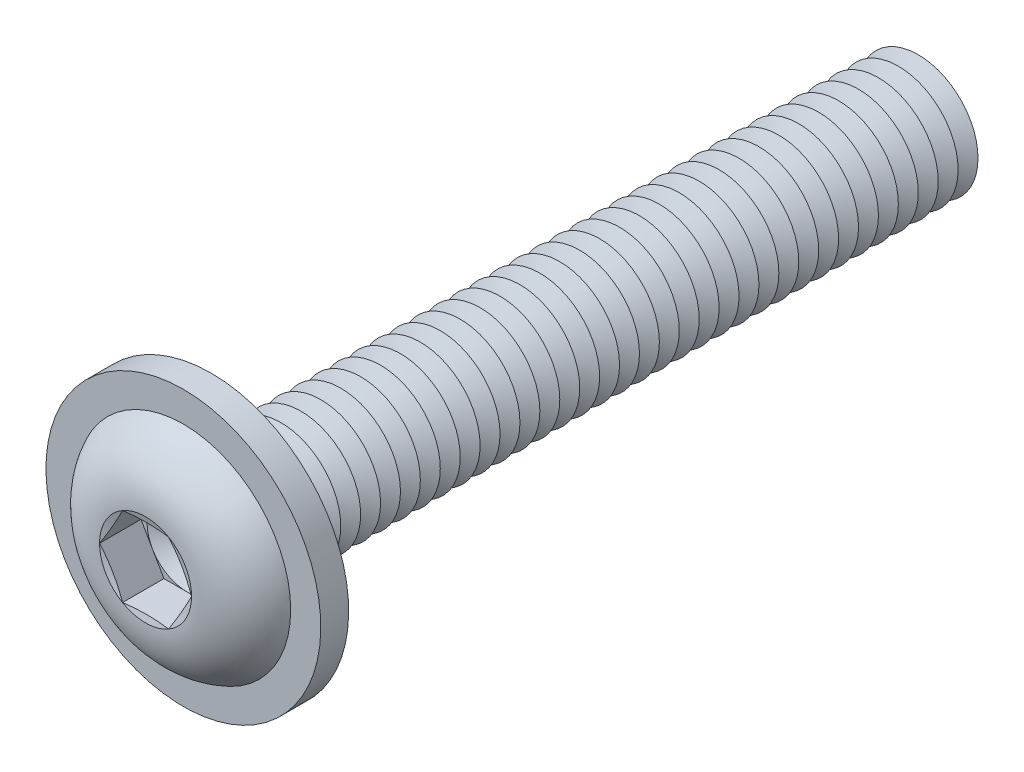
ISO-10303-21;
HEADER;
FILE_DESCRIPTION(('STEP AP214'),'2;1');
FILE_NAME('part.step','',(''),(''),'','','');
FILE_SCHEMA(('AUTOMOTIVE_DESIGN { 1 0 10303 214 1 1 1 1 }'));
ENDSEC;
DATA;
#1=APPLICATION_CONTEXT('core data for automotive mechanical design processes');
#2=APPLICATION_PROTOCOL_DEFINITION('international standard','automotive_design',2000,#1);
#3=PRODUCT_CONTEXT('',#1,'mechanical');
#4=PRODUCT('Part','Part','',(#3));
#5=PRODUCT_RELATED_PRODUCT_CATEGORY('part','',(#4));
#6=PRODUCT_DEFINITION_FORMATION('','',#4);
#7=PRODUCT_DEFINITION_CONTEXT('part definition',#1,'design');
#8=PRODUCT_DEFINITION('design','',#6,#7);
#9=PRODUCT_DEFINITION_SHAPE('','',#8);
#10=(LENGTH_UNIT() NAMED_UNIT(*) SI_UNIT(.MILLI.,.METRE.));
#11=(NAMED_UNIT(*) PLANE_ANGLE_UNIT() SI_UNIT($,.RADIAN.));
#12=(NAMED_UNIT(*) SI_UNIT($,.STERADIAN.) SOLID_ANGLE_UNIT());
#13=UNCERTAINTY_MEASURE_WITH_UNIT(LENGTH_MEASURE(1.E-05),#10,'distance_accuracy_value','');
#14=(GEOMETRIC_REPRESENTATION_CONTEXT(3) GLOBAL_UNCERTAINTY_ASSIGNED_CONTEXT((#13)) GLOBAL_UNIT_ASSIGNED_CONTEXT((#10,
#11,#12)) REPRESENTATION_CONTEXT('',''));
#15=CARTESIAN_POINT('',(0.,0.,0.));
#16=DIRECTION('',(0.,0.,1.));
#17=DIRECTION('',(1.,0.,0.));
#18=AXIS2_PLACEMENT_3D('',#15,#16,#17);
#19=CARTESIAN_POINT('',(0.,0.,-16.25));
#20=DIRECTION('',(0.,0.,1.));
#21=DIRECTION('',(1.,0.,0.));
#22=AXIS2_PLACEMENT_3D('',#19,#20,#21);
#23=CONICAL_SURFACE('',#22,1.5,1.0471975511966);
#24=CARTESIAN_POINT('',(0.,0.,-16.5));
#25=DIRECTION('',(0.,0.,1.));
#26=DIRECTION('',(1.,0.,0.));
#27=AXIS2_PLACEMENT_3D('',#24,#25,#26);
#28=CIRCLE('',#27,1.06698729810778);
#29=CARTESIAN_POINT('',(1.06698729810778,0.,-16.5));
#30=VERTEX_POINT('',#29);
#31=EDGE_CURVE('E497',#30,#30,#28,.T.);
#32=ORIENTED_EDGE('',*,*,#31,.T.);
#33=EDGE_LOOP('',(#32));
#34=FACE_BOUND('',#33,.T.);
#35=CARTESIAN_POINT('',(0.,0.,-16.25));
#36=DIRECTION('',(0.,0.,1.));
#37=DIRECTION('',(1.,0.,0.));
#38=AXIS2_PLACEMENT_3D('',#35,#36,#37);
#39=CIRCLE('',#38,1.5);
#40=CARTESIAN_POINT('',(1.5,0.,-16.25));
#41=VERTEX_POINT('',#40);
#42=EDGE_CURVE('E493',#41,#41,#39,.T.);
#43=ORIENTED_EDGE('',*,*,#42,.F.);
#44=EDGE_LOOP('',(#43));
#45=FACE_BOUND('',#44,.T.);
#46=ADVANCED_FACE('F39',(#34,#45),#23,.T.);
#47=CARTESIAN_POINT('',(0.,0.,-16.5));
#48=DIRECTION('',(0.,0.,-1.));
#49=DIRECTION('',(-1.,0.,0.));
#50=AXIS2_PLACEMENT_3D('',#47,#48,#49);
#51=CONICAL_SURFACE('',#50,1.06698729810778,1.0471975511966);
#52=CARTESIAN_POINT('',(0.,0.,-16.75));
#53=DIRECTION('',(0.,0.,1.));
#54=DIRECTION('',(1.,0.,0.));
#55=AXIS2_PLACEMENT_3D('',#52,#53,#54);
#56=CIRCLE('',#55,1.5);
#57=CARTESIAN_POINT('',(1.5,0.,-16.75));
#58=VERTEX_POINT('',#57);
#59=EDGE_CURVE('E501',#58,#58,#56,.T.);
#60=ORIENTED_EDGE('',*,*,#59,.T.);
#61=EDGE_LOOP('',(#60));
#62=FACE_BOUND('',#61,.T.);
#63=ORIENTED_EDGE('',*,*,#31,.F.);
#64=EDGE_LOOP('',(#63));
#65=FACE_BOUND('',#64,.T.);
#66=ADVANCED_FACE('F626',(#62,#65),#51,.T.);
#67=CARTESIAN_POINT('',(0.,1.50000000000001,-18.));
#68=DIRECTION('',(0.,0.,-1.));
#69=DIRECTION('',(-1.,0.,0.));
#70=AXIS2_PLACEMENT_3D('',#67,#68,#69);
#71=PLANE('',#70);
#72=CARTESIAN_POINT('',(0.,0.,-18.));
#73=DIRECTION('',(0.,0.,1.));
#74=DIRECTION('',(1.,0.,0.));
#75=AXIS2_PLACEMENT_3D('',#72,#73,#74);
#76=CIRCLE('',#75,1.06698729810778);
#77=CARTESIAN_POINT('',(1.06698729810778,0.,-18.));
#78=VERTEX_POINT('',#77);
#79=EDGE_CURVE('E521',#78,#78,#76,.T.);
#80=ORIENTED_EDGE('',*,*,#79,.F.);
#81=EDGE_LOOP('',(#80));
#82=FACE_BOUND('',#81,.T.);
#83=ADVANCED_FACE('F632',(#82),#71,.T.);
#84=CARTESIAN_POINT('',(0.,0.,-17.75));
#85=DIRECTION('',(0.,0.,1.));
#86=DIRECTION('',(1.,0.,0.));
#87=AXIS2_PLACEMENT_3D('',#84,#85,#86);
#88=CONICAL_SURFACE('',#87,1.5,1.0471975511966);
#89=ORIENTED_EDGE('',*,*,#79,.T.);
#90=EDGE_LOOP('',(#89));
#91=FACE_BOUND('',#90,.T.);
#92=CARTESIAN_POINT('',(0.,0.,-17.75));
#93=DIRECTION('',(0.,0.,1.));
#94=DIRECTION('',(1.,0.,0.));
#95=AXIS2_PLACEMENT_3D('',#92,#93,#94);
#96=CIRCLE('',#95,1.5);
#97=CARTESIAN_POINT('',(1.5,0.,-17.75));
#98=VERTEX_POINT('',#97);
#99=EDGE_CURVE('E517',#98,#98,#96,.T.);
#100=ORIENTED_EDGE('',*,*,#99,.F.);
#101=EDGE_LOOP('',(#100));
#102=FACE_BOUND('',#101,.T.);
#103=ADVANCED_FACE('F651',(#91,#102),#88,.T.);
#104=CARTESIAN_POINT('',(0.,0.,-17.5));
#105=DIRECTION('',(0.,0.,-1.));
#106=DIRECTION('',(-1.,0.,0.));
#107=AXIS2_PLACEMENT_3D('',#104,#105,#106);
#108=CONICAL_SURFACE('',#107,1.06698729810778,1.0471975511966);
#109=ORIENTED_EDGE('',*,*,#99,.T.);
#110=EDGE_LOOP('',(#109));
#111=FACE_BOUND('',#110,.T.);
#112=CARTESIAN_POINT('',(0.,0.,-17.5));
#113=DIRECTION('',(0.,0.,1.));
#114=DIRECTION('',(1.,0.,0.));
#115=AXIS2_PLACEMENT_3D('',#112,#113,#114);
#116=CIRCLE('',#115,1.06698729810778);
#117=CARTESIAN_POINT('',(1.06698729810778,0.,-17.5));
#118=VERTEX_POINT('',#117);
#119=EDGE_CURVE('E513',#118,#118,#116,.T.);
#120=ORIENTED_EDGE('',*,*,#119,.F.);
#121=EDGE_LOOP('',(#120));
#122=FACE_BOUND('',#121,.T.);
#123=ADVANCED_FACE('F648',(#111,#122),#108,.T.);
#124=CARTESIAN_POINT('',(0.,0.,-17.25));
#125=DIRECTION('',(0.,0.,1.));
#126=DIRECTION('',(1.,0.,0.));
#127=AXIS2_PLACEMENT_3D('',#124,#125,#126);
#128=CONICAL_SURFACE('',#127,1.5,1.0471975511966);
#129=ORIENTED_EDGE('',*,*,#119,.T.);
#130=EDGE_LOOP('',(#129));
#131=FACE_BOUND('',#130,.T.);
#132=CARTESIAN_POINT('',(0.,0.,-17.25));
#133=DIRECTION('',(0.,0.,1.));
#134=DIRECTION('',(1.,0.,0.));
#135=AXIS2_PLACEMENT_3D('',#132,#133,#134);
#136=CIRCLE('',#135,1.5);
#137=CARTESIAN_POINT('',(1.5,0.,-17.25));
#138=VERTEX_POINT('',#137);
#139=EDGE_CURVE('E509',#138,#138,#136,.T.);
#140=ORIENTED_EDGE('',*,*,#139,.F.);
#141=EDGE_LOOP('',(#140));
#142=FACE_BOUND('',#141,.T.);
#143=ADVANCED_FACE('F642',(#131,#142),#128,.T.);
#144=CARTESIAN_POINT('',(0.,0.,-17.));
#145=DIRECTION('',(0.,0.,-1.));
#146=DIRECTION('',(-1.,0.,0.));
#147=AXIS2_PLACEMENT_3D('',#144,#145,#146);
#148=CONICAL_SURFACE('',#147,1.06698729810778,1.0471975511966);
#149=ORIENTED_EDGE('',*,*,#139,.T.);
#150=EDGE_LOOP('',(#149));
#151=FACE_BOUND('',#150,.T.);
#152=CARTESIAN_POINT('',(0.,0.,-17.));
#153=DIRECTION('',(0.,0.,1.));
#154=DIRECTION('',(1.,0.,0.));
#155=AXIS2_PLACEMENT_3D('',#152,#153,#154);
#156=CIRCLE('',#155,1.06698729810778);
#157=CARTESIAN_POINT('',(1.06698729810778,0.,-17.));
#158=VERTEX_POINT('',#157);
#159=EDGE_CURVE('E505',#158,#158,#156,.T.);
#160=ORIENTED_EDGE('',*,*,#159,.F.);
#161=EDGE_LOOP('',(#160));
#162=FACE_BOUND('',#161,.T.);
#163=ADVANCED_FACE('F638',(#151,#162),#148,.T.);
#164=CARTESIAN_POINT('',(0.,0.,-16.75));
#165=DIRECTION('',(0.,0.,1.));
#166=DIRECTION('',(1.,0.,0.));
#167=AXIS2_PLACEMENT_3D('',#164,#165,#166);
#168=CONICAL_SURFACE('',#167,1.5,1.0471975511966);
#169=ORIENTED_EDGE('',*,*,#159,.T.);
#170=EDGE_LOOP('',(#169));
#171=FACE_BOUND('',#170,.T.);
#172=ORIENTED_EDGE('',*,*,#59,.F.);
#173=EDGE_LOOP('',(#172));
#174=FACE_BOUND('',#173,.T.);
#175=ADVANCED_FACE('F641',(#171,#174),#168,.T.);
#176=CARTESIAN_POINT('',(0.,0.,-15.75));
#177=DIRECTION('',(0.,0.,1.));
#178=DIRECTION('',(1.,0.,0.));
#179=AXIS2_PLACEMENT_3D('',#176,#177,#178);
#180=CONICAL_SURFACE('',#179,1.5,1.0471975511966);
#181=CARTESIAN_POINT('',(0.,0.,-16.));
#182=DIRECTION('',(0.,0.,1.));
#183=DIRECTION('',(1.,0.,0.));
#184=AXIS2_PLACEMENT_3D('',#181,#182,#183);
#185=CIRCLE('',#184,1.06698729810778);
#186=CARTESIAN_POINT('',(1.06698729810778,0.,-16.));
#187=VERTEX_POINT('',#186);
#188=EDGE_CURVE('E489',#187,#187,#185,.T.);
#189=ORIENTED_EDGE('',*,*,#188,.T.);
#190=EDGE_LOOP('',(#189));
#191=FACE_BOUND('',#190,.T.);
#192=CARTESIAN_POINT('',(0.,0.,-15.75));
#193=DIRECTION('',(0.,0.,1.));
#194=DIRECTION('',(1.,0.,0.));
#195=AXIS2_PLACEMENT_3D('',#192,#193,#194);
#196=CIRCLE('',#195,1.5);
#197=CARTESIAN_POINT('',(1.5,0.,-15.75));
#198=VERTEX_POINT('',#197);
#199=EDGE_CURVE('E485',#198,#198,#196,.T.);
#200=ORIENTED_EDGE('',*,*,#199,.F.);
#201=EDGE_LOOP('',(#200));
#202=FACE_BOUND('',#201,.T.);
#203=ADVANCED_FACE('F646',(#191,#202),#180,.T.);
#204=CARTESIAN_POINT('',(0.,0.,-16.));
#205=DIRECTION('',(0.,0.,-1.));
#206=DIRECTION('',(-1.,0.,0.));
#207=AXIS2_PLACEMENT_3D('',#204,#205,#206);
#208=CONICAL_SURFACE('',#207,1.06698729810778,1.0471975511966);
#209=ORIENTED_EDGE('',*,*,#42,.T.);
#210=EDGE_LOOP('',(#209));
#211=FACE_BOUND('',#210,.T.);
#212=ORIENTED_EDGE('',*,*,#188,.F.);
#213=EDGE_LOOP('',(#212));
#214=FACE_BOUND('',#213,.T.);
#215=ADVANCED_FACE('F697',(#211,#214),#208,.T.);
#216=CARTESIAN_POINT('',(0.,0.,-15.25));
#217=DIRECTION('',(0.,0.,1.));
#218=DIRECTION('',(1.,0.,0.));
#219=AXIS2_PLACEMENT_3D('',#216,#217,#218);
#220=CONICAL_SURFACE('',#219,1.5,1.0471975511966);
#221=CARTESIAN_POINT('',(0.,0.,-15.5));
#222=DIRECTION('',(0.,0.,1.));
#223=DIRECTION('',(1.,0.,0.));
#224=AXIS2_PLACEMENT_3D('',#221,#222,#223);
#225=CIRCLE('',#224,1.06698729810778);
#226=CARTESIAN_POINT('',(1.06698729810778,0.,-15.5));
#227=VERTEX_POINT('',#226);
#228=EDGE_CURVE('E481',#227,#227,#225,.T.);
#229=ORIENTED_EDGE('',*,*,#228,.T.);
#230=EDGE_LOOP('',(#229));
#231=FACE_BOUND('',#230,.T.);
#232=CARTESIAN_POINT('',(0.,0.,-15.25));
#233=DIRECTION('',(0.,0.,1.));
#234=DIRECTION('',(1.,0.,0.));
#235=AXIS2_PLACEMENT_3D('',#232,#233,#234);
#236=CIRCLE('',#235,1.5);
#237=CARTESIAN_POINT('',(1.5,0.,-15.25));
#238=VERTEX_POINT('',#237);
#239=EDGE_CURVE('E477',#238,#238,#236,.T.);
#240=ORIENTED_EDGE('',*,*,#239,.F.);
#241=EDGE_LOOP('',(#240));
#242=FACE_BOUND('',#241,.T.);
#243=ADVANCED_FACE('F703',(#231,#242),#220,.T.);
#244=CARTESIAN_POINT('',(0.,0.,-15.5));
#245=DIRECTION('',(0.,0.,-1.));
#246=DIRECTION('',(-1.,0.,0.));
#247=AXIS2_PLACEMENT_3D('',#244,#245,#246);
#248=CONICAL_SURFACE('',#247,1.06698729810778,1.0471975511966);
#249=ORIENTED_EDGE('',*,*,#199,.T.);
#250=EDGE_LOOP('',(#249));
#251=FACE_BOUND('',#250,.T.);
#252=ORIENTED_EDGE('',*,*,#228,.F.);
#253=EDGE_LOOP('',(#252));
#254=FACE_BOUND('',#253,.T.);
#255=ADVANCED_FACE('F710',(#251,#254),#248,.T.);
#256=CARTESIAN_POINT('',(0.,0.,-14.75));
#257=DIRECTION('',(0.,0.,1.));
#258=DIRECTION('',(1.,0.,0.));
#259=AXIS2_PLACEMENT_3D('',#256,#257,#258);
#260=CONICAL_SURFACE('',#259,1.5,1.0471975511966);
#261=CARTESIAN_POINT('',(0.,0.,-15.));
#262=DIRECTION('',(0.,0.,1.));
#263=DIRECTION('',(1.,0.,0.));
#264=AXIS2_PLACEMENT_3D('',#261,#262,#263);
#265=CIRCLE('',#264,1.06698729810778);
#266=CARTESIAN_POINT('',(1.06698729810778,0.,-15.));
#267=VERTEX_POINT('',#266);
#268=EDGE_CURVE('E473',#267,#267,#265,.T.);
#269=ORIENTED_EDGE('',*,*,#268,.T.);
#270=EDGE_LOOP('',(#269));
#271=FACE_BOUND('',#270,.T.);
#272=CARTESIAN_POINT('',(0.,0.,-14.75));
#273=DIRECTION('',(0.,0.,1.));
#274=DIRECTION('',(1.,0.,0.));
#275=AXIS2_PLACEMENT_3D('',#272,#273,#274);
#276=CIRCLE('',#275,1.5);
#277=CARTESIAN_POINT('',(1.5,0.,-14.75));
#278=VERTEX_POINT('',#277);
#279=EDGE_CURVE('E469',#278,#278,#276,.T.);
#280=ORIENTED_EDGE('',*,*,#279,.F.);
#281=EDGE_LOOP('',(#280));
#282=FACE_BOUND('',#281,.T.);
#283=ADVANCED_FACE('F717',(#271,#282),#260,.T.);
#284=CARTESIAN_POINT('',(0.,0.,-15.));
#285=DIRECTION('',(0.,0.,-1.));
#286=DIRECTION('',(-1.,0.,0.));
#287=AXIS2_PLACEMENT_3D('',#284,#285,#286);
#288=CONICAL_SURFACE('',#287,1.06698729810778,1.0471975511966);
#289=ORIENTED_EDGE('',*,*,#239,.T.);
#290=EDGE_LOOP('',(#289));
#291=FACE_BOUND('',#290,.T.);
#292=ORIENTED_EDGE('',*,*,#268,.F.);
#293=EDGE_LOOP('',(#292));
#294=FACE_BOUND('',#293,.T.);
#295=ADVANCED_FACE('F724',(#291,#294),#288,.T.);
#296=CARTESIAN_POINT('',(0.,0.,-14.25));
#297=DIRECTION('',(0.,0.,1.));
#298=DIRECTION('',(1.,0.,0.));
#299=AXIS2_PLACEMENT_3D('',#296,#297,#298);
#300=CONICAL_SURFACE('',#299,1.5,1.0471975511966);
#301=CARTESIAN_POINT('',(0.,0.,-14.5));
#302=DIRECTION('',(0.,0.,1.));
#303=DIRECTION('',(1.,0.,0.));
#304=AXIS2_PLACEMENT_3D('',#301,#302,#303);
#305=CIRCLE('',#304,1.06698729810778);
#306=CARTESIAN_POINT('',(1.06698729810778,0.,-14.5));
#307=VERTEX_POINT('',#306);
#308=EDGE_CURVE('E465',#307,#307,#305,.T.);
#309=ORIENTED_EDGE('',*,*,#308,.T.);
#310=EDGE_LOOP('',(#309));
#311=FACE_BOUND('',#310,.T.);
#312=CARTESIAN_POINT('',(0.,0.,-14.25));
#313=DIRECTION('',(0.,0.,1.));
#314=DIRECTION('',(1.,0.,0.));
#315=AXIS2_PLACEMENT_3D('',#312,#313,#314);
#316=CIRCLE('',#315,1.5);
#317=CARTESIAN_POINT('',(1.5,0.,-14.25));
#318=VERTEX_POINT('',#317);
#319=EDGE_CURVE('E461',#318,#318,#316,.T.);
#320=ORIENTED_EDGE('',*,*,#319,.F.);
#321=EDGE_LOOP('',(#320));
#322=FACE_BOUND('',#321,.T.);
#323=ADVANCED_FACE('F731',(#311,#322),#300,.T.);
#324=CARTESIAN_POINT('',(0.,0.,-14.5));
#325=DIRECTION('',(0.,0.,-1.));
#326=DIRECTION('',(-1.,0.,0.));
#327=AXIS2_PLACEMENT_3D('',#324,#325,#326);
#328=CONICAL_SURFACE('',#327,1.06698729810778,1.0471975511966);
#329=ORIENTED_EDGE('',*,*,#279,.T.);
#330=EDGE_LOOP('',(#329));
#331=FACE_BOUND('',#330,.T.);
#332=ORIENTED_EDGE('',*,*,#308,.F.);
#333=EDGE_LOOP('',(#332));
#334=FACE_BOUND('',#333,.T.);
#335=ADVANCED_FACE('F738',(#331,#334),#328,.T.);
#336=CARTESIAN_POINT('',(0.,0.,-13.75));
#337=DIRECTION('',(0.,0.,1.));
#338=DIRECTION('',(1.,0.,0.));
#339=AXIS2_PLACEMENT_3D('',#336,#337,#338);
#340=CONICAL_SURFACE('',#339,1.5,1.0471975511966);
#341=CARTESIAN_POINT('',(0.,0.,-14.));
#342=DIRECTION('',(0.,0.,1.));
#343=DIRECTION('',(1.,0.,0.));
#344=AXIS2_PLACEMENT_3D('',#341,#342,#343);
#345=CIRCLE('',#344,1.06698729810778);
#346=CARTESIAN_POINT('',(1.06698729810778,0.,-14.));
#347=VERTEX_POINT('',#346);
#348=EDGE_CURVE('E457',#347,#347,#345,.T.);
#349=ORIENTED_EDGE('',*,*,#348,.T.);
#350=EDGE_LOOP('',(#349));
#351=FACE_BOUND('',#350,.T.);
#352=CARTESIAN_POINT('',(0.,0.,-13.75));
#353=DIRECTION('',(0.,0.,1.));
#354=DIRECTION('',(1.,0.,0.));
#355=AXIS2_PLACEMENT_3D('',#352,#353,#354);
#356=CIRCLE('',#355,1.5);
#357=CARTESIAN_POINT('',(1.5,0.,-13.75));
#358=VERTEX_POINT('',#357);
#359=EDGE_CURVE('E453',#358,#358,#356,.T.);
#360=ORIENTED_EDGE('',*,*,#359,.F.);
#361=EDGE_LOOP('',(#360));
#362=FACE_BOUND('',#361,.T.);
#363=ADVANCED_FACE('F745',(#351,#362),#340,.T.);
#364=CARTESIAN_POINT('',(0.,0.,-14.));
#365=DIRECTION('',(0.,0.,-1.));
#366=DIRECTION('',(-1.,0.,0.));
#367=AXIS2_PLACEMENT_3D('',#364,#365,#366);
#368=CONICAL_SURFACE('',#367,1.06698729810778,1.0471975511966);
#369=ORIENTED_EDGE('',*,*,#319,.T.);
#370=EDGE_LOOP('',(#369));
#371=FACE_BOUND('',#370,.T.);
#372=ORIENTED_EDGE('',*,*,#348,.F.);
#373=EDGE_LOOP('',(#372));
#374=FACE_BOUND('',#373,.T.);
#375=ADVANCED_FACE('F752',(#371,#374),#368,.T.);
#376=CARTESIAN_POINT('',(0.,0.,-13.25));
#377=DIRECTION('',(0.,0.,1.));
#378=DIRECTION('',(1.,0.,0.));
#379=AXIS2_PLACEMENT_3D('',#376,#377,#378);
#380=CONICAL_SURFACE('',#379,1.5,1.0471975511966);
#381=CARTESIAN_POINT('',(0.,0.,-13.5));
#382=DIRECTION('',(0.,0.,1.));
#383=DIRECTION('',(1.,0.,0.));
#384=AXIS2_PLACEMENT_3D('',#381,#382,#383);
#385=CIRCLE('',#384,1.06698729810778);
#386=CARTESIAN_POINT('',(1.06698729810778,0.,-13.5));
#387=VERTEX_POINT('',#386);
#388=EDGE_CURVE('E449',#387,#387,#385,.T.);
#389=ORIENTED_EDGE('',*,*,#388,.T.);
#390=EDGE_LOOP('',(#389));
#391=FACE_BOUND('',#390,.T.);
#392=CARTESIAN_POINT('',(0.,0.,-13.25));
#393=DIRECTION('',(0.,0.,1.));
#394=DIRECTION('',(1.,0.,0.));
#395=AXIS2_PLACEMENT_3D('',#392,#393,#394);
#396=CIRCLE('',#395,1.5);
#397=CARTESIAN_POINT('',(1.5,0.,-13.25));
#398=VERTEX_POINT('',#397);
#399=EDGE_CURVE('E445',#398,#398,#396,.T.);
#400=ORIENTED_EDGE('',*,*,#399,.F.);
#401=EDGE_LOOP('',(#400));
#402=FACE_BOUND('',#401,.T.);
#403=ADVANCED_FACE('F759',(#391,#402),#380,.T.);
#404=CARTESIAN_POINT('',(0.,0.,-13.5));
#405=DIRECTION('',(0.,0.,-1.));
#406=DIRECTION('',(-1.,0.,0.));
#407=AXIS2_PLACEMENT_3D('',#404,#405,#406);
#408=CONICAL_SURFACE('',#407,1.06698729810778,1.0471975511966);
#409=ORIENTED_EDGE('',*,*,#359,.T.);
#410=EDGE_LOOP('',(#409));
#411=FACE_BOUND('',#410,.T.);
#412=ORIENTED_EDGE('',*,*,#388,.F.);
#413=EDGE_LOOP('',(#412));
#414=FACE_BOUND('',#413,.T.);
#415=ADVANCED_FACE('F766',(#411,#414),#408,.T.);
#416=CARTESIAN_POINT('',(0.,0.,-12.75));
#417=DIRECTION('',(0.,0.,1.));
#418=DIRECTION('',(1.,0.,0.));
#419=AXIS2_PLACEMENT_3D('',#416,#417,#418);
#420=CONICAL_SURFACE('',#419,1.5,1.0471975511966);
#421=CARTESIAN_POINT('',(0.,0.,-13.));
#422=DIRECTION('',(0.,0.,1.));
#423=DIRECTION('',(1.,0.,0.));
#424=AXIS2_PLACEMENT_3D('',#421,#422,#423);
#425=CIRCLE('',#424,1.06698729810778);
#426=CARTESIAN_POINT('',(1.06698729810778,0.,-13.));
#427=VERTEX_POINT('',#426);
#428=EDGE_CURVE('E441',#427,#427,#425,.T.);
#429=ORIENTED_EDGE('',*,*,#428,.T.);
#430=EDGE_LOOP('',(#429));
#431=FACE_BOUND('',#430,.T.);
#432=CARTESIAN_POINT('',(0.,0.,-12.75));
#433=DIRECTION('',(0.,0.,1.));
#434=DIRECTION('',(1.,0.,0.));
#435=AXIS2_PLACEMENT_3D('',#432,#433,#434);
#436=CIRCLE('',#435,1.5);
#437=CARTESIAN_POINT('',(1.5,0.,-12.75));
#438=VERTEX_POINT('',#437);
#439=EDGE_CURVE('E437',#438,#438,#436,.T.);
#440=ORIENTED_EDGE('',*,*,#439,.F.);
#441=EDGE_LOOP('',(#440));
#442=FACE_BOUND('',#441,.T.);
#443=ADVANCED_FACE('F773',(#431,#442),#420,.T.);
#444=CARTESIAN_POINT('',(0.,0.,-13.));
#445=DIRECTION('',(0.,0.,-1.));
#446=DIRECTION('',(-1.,0.,0.));
#447=AXIS2_PLACEMENT_3D('',#444,#445,#446);
#448=CONICAL_SURFACE('',#447,1.06698729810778,1.0471975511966);
#449=ORIENTED_EDGE('',*,*,#399,.T.);
#450=EDGE_LOOP('',(#449));
#451=FACE_BOUND('',#450,.T.);
#452=ORIENTED_EDGE('',*,*,#428,.F.);
#453=EDGE_LOOP('',(#452));
#454=FACE_BOUND('',#453,.T.);
#455=ADVANCED_FACE('F780',(#451,#454),#448,.T.);
#456=CARTESIAN_POINT('',(0.,0.,-12.25));
#457=DIRECTION('',(0.,0.,1.));
#458=DIRECTION('',(1.,0.,0.));
#459=AXIS2_PLACEMENT_3D('',#456,#457,#458);
#460=CONICAL_SURFACE('',#459,1.5,1.0471975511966);
#461=CARTESIAN_POINT('',(0.,0.,-12.5));
#462=DIRECTION('',(0.,0.,1.));
#463=DIRECTION('',(1.,0.,0.));
#464=AXIS2_PLACEMENT_3D('',#461,#462,#463);
#465=CIRCLE('',#464,1.06698729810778);
#466=CARTESIAN_POINT('',(1.06698729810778,0.,-12.5));
#467=VERTEX_POINT('',#466);
#468=EDGE_CURVE('E433',#467,#467,#465,.T.);
#469=ORIENTED_EDGE('',*,*,#468,.T.);
#470=EDGE_LOOP('',(#469));
#471=FACE_BOUND('',#470,.T.);
#472=CARTESIAN_POINT('',(0.,0.,-12.25));
#473=DIRECTION('',(0.,0.,1.));
#474=DIRECTION('',(1.,0.,0.));
#475=AXIS2_PLACEMENT_3D('',#472,#473,#474);
#476=CIRCLE('',#475,1.5);
#477=CARTESIAN_POINT('',(1.5,0.,-12.25));
#478=VERTEX_POINT('',#477);
#479=EDGE_CURVE('E429',#478,#478,#476,.T.);
#480=ORIENTED_EDGE('',*,*,#479,.F.);
#481=EDGE_LOOP('',(#480));
#482=FACE_BOUND('',#481,.T.);
#483=ADVANCED_FACE('F787',(#471,#482),#460,.T.);
#484=CARTESIAN_POINT('',(0.,0.,-12.5));
#485=DIRECTION('',(0.,0.,-1.));
#486=DIRECTION('',(-1.,0.,0.));
#487=AXIS2_PLACEMENT_3D('',#484,#485,#486);
#488=CONICAL_SURFACE('',#487,1.06698729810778,1.0471975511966);
#489=ORIENTED_EDGE('',*,*,#439,.T.);
#490=EDGE_LOOP('',(#489));
#491=FACE_BOUND('',#490,.T.);
#492=ORIENTED_EDGE('',*,*,#468,.F.);
#493=EDGE_LOOP('',(#492));
#494=FACE_BOUND('',#493,.T.);
#495=ADVANCED_FACE('F794',(#491,#494),#488,.T.);
#496=CARTESIAN_POINT('',(0.,0.,-11.75));
#497=DIRECTION('',(0.,0.,1.));
#498=DIRECTION('',(1.,0.,0.));
#499=AXIS2_PLACEMENT_3D('',#496,#497,#498);
#500=CONICAL_SURFACE('',#499,1.5,1.0471975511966);
#501=CARTESIAN_POINT('',(0.,0.,-12.));
#502=DIRECTION('',(0.,0.,1.));
#503=DIRECTION('',(1.,0.,0.));
#504=AXIS2_PLACEMENT_3D('',#501,#502,#503);
#505=CIRCLE('',#504,1.06698729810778);
#506=CARTESIAN_POINT('',(1.06698729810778,0.,-12.));
#507=VERTEX_POINT('',#506);
#508=EDGE_CURVE('E425',#507,#507,#505,.T.);
#509=ORIENTED_EDGE('',*,*,#508,.T.);
#510=EDGE_LOOP('',(#509));
#511=FACE_BOUND('',#510,.T.);
#512=CARTESIAN_POINT('',(0.,0.,-11.75));
#513=DIRECTION('',(0.,0.,1.));
#514=DIRECTION('',(1.,0.,0.));
#515=AXIS2_PLACEMENT_3D('',#512,#513,#514);
#516=CIRCLE('',#515,1.5);
#517=CARTESIAN_POINT('',(1.5,0.,-11.75));
#518=VERTEX_POINT('',#517);
#519=EDGE_CURVE('E421',#518,#518,#516,.T.);
#520=ORIENTED_EDGE('',*,*,#519,.F.);
#521=EDGE_LOOP('',(#520));
#522=FACE_BOUND('',#521,.T.);
#523=ADVANCED_FACE('F801',(#511,#522),#500,.T.);
#524=CARTESIAN_POINT('',(0.,0.,-12.));
#525=DIRECTION('',(0.,0.,-1.));
#526=DIRECTION('',(-1.,0.,0.));
#527=AXIS2_PLACEMENT_3D('',#524,#525,#526);
#528=CONICAL_SURFACE('',#527,1.06698729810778,1.0471975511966);
#529=ORIENTED_EDGE('',*,*,#479,.T.);
#530=EDGE_LOOP('',(#529));
#531=FACE_BOUND('',#530,.T.);
#532=ORIENTED_EDGE('',*,*,#508,.F.);
#533=EDGE_LOOP('',(#532));
#534=FACE_BOUND('',#533,.T.);
#535=ADVANCED_FACE('F808',(#531,#534),#528,.T.);
#536=CARTESIAN_POINT('',(0.,0.,-11.25));
#537=DIRECTION('',(0.,0.,1.));
#538=DIRECTION('',(1.,0.,0.));
#539=AXIS2_PLACEMENT_3D('',#536,#537,#538);
#540=CONICAL_SURFACE('',#539,1.5,1.0471975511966);
#541=CARTESIAN_POINT('',(0.,0.,-11.5));
#542=DIRECTION('',(0.,0.,1.));
#543=DIRECTION('',(1.,0.,0.));
#544=AXIS2_PLACEMENT_3D('',#541,#542,#543);
#545=CIRCLE('',#544,1.06698729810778);
#546=CARTESIAN_POINT('',(1.06698729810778,0.,-11.5));
#547=VERTEX_POINT('',#546);
#548=EDGE_CURVE('E417',#547,#547,#545,.T.);
#549=ORIENTED_EDGE('',*,*,#548,.T.);
#550=EDGE_LOOP('',(#549));
#551=FACE_BOUND('',#550,.T.);
#552=CARTESIAN_POINT('',(0.,0.,-11.25));
#553=DIRECTION('',(0.,0.,1.));
#554=DIRECTION('',(1.,0.,0.));
#555=AXIS2_PLACEMENT_3D('',#552,#553,#554);
#556=CIRCLE('',#555,1.5);
#557=CARTESIAN_POINT('',(1.5,0.,-11.25));
#558=VERTEX_POINT('',#557);
#559=EDGE_CURVE('E413',#558,#558,#556,.T.);
#560=ORIENTED_EDGE('',*,*,#559,.F.);
#561=EDGE_LOOP('',(#560));
#562=FACE_BOUND('',#561,.T.);
#563=ADVANCED_FACE('F815',(#551,#562),#540,.T.);
#564=CARTESIAN_POINT('',(0.,0.,-11.5));
#565=DIRECTION('',(0.,0.,-1.));
#566=DIRECTION('',(-1.,0.,0.));
#567=AXIS2_PLACEMENT_3D('',#564,#565,#566);
#568=CONICAL_SURFACE('',#567,1.06698729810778,1.0471975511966);
#569=ORIENTED_EDGE('',*,*,#519,.T.);
#570=EDGE_LOOP('',(#569));
#571=FACE_BOUND('',#570,.T.);
#572=ORIENTED_EDGE('',*,*,#548,.F.);
#573=EDGE_LOOP('',(#572));
#574=FACE_BOUND('',#573,.T.);
#575=ADVANCED_FACE('F822',(#571,#574),#568,.T.);
#576=CARTESIAN_POINT('',(0.,0.,-10.75));
#577=DIRECTION('',(0.,0.,1.));
#578=DIRECTION('',(1.,0.,0.));
#579=AXIS2_PLACEMENT_3D('',#576,#577,#578);
#580=CONICAL_SURFACE('',#579,1.5,1.0471975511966);
#581=CARTESIAN_POINT('',(0.,0.,-11.));
#582=DIRECTION('',(0.,0.,1.));
#583=DIRECTION('',(1.,0.,0.));
#584=AXIS2_PLACEMENT_3D('',#581,#582,#583);
#585=CIRCLE('',#584,1.06698729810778);
#586=CARTESIAN_POINT('',(1.06698729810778,0.,-11.));
#587=VERTEX_POINT('',#586);
#588=EDGE_CURVE('E409',#587,#587,#585,.T.);
#589=ORIENTED_EDGE('',*,*,#588,.T.);
#590=EDGE_LOOP('',(#589));
#591=FACE_BOUND('',#590,.T.);
#592=CARTESIAN_POINT('',(0.,0.,-10.75));
#593=DIRECTION('',(0.,0.,1.));
#594=DIRECTION('',(1.,0.,0.));
#595=AXIS2_PLACEMENT_3D('',#592,#593,#594);
#596=CIRCLE('',#595,1.5);
#597=CARTESIAN_POINT('',(1.5,0.,-10.75));
#598=VERTEX_POINT('',#597);
#599=EDGE_CURVE('E405',#598,#598,#596,.T.);
#600=ORIENTED_EDGE('',*,*,#599,.F.);
#601=EDGE_LOOP('',(#600));
#602=FACE_BOUND('',#601,.T.);
#603=ADVANCED_FACE('F829',(#591,#602),#580,.T.);
#604=CARTESIAN_POINT('',(0.,0.,-11.));
#605=DIRECTION('',(0.,0.,-1.));
#606=DIRECTION('',(-1.,0.,0.));
#607=AXIS2_PLACEMENT_3D('',#604,#605,#606);
#608=CONICAL_SURFACE('',#607,1.06698729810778,1.0471975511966);
#609=ORIENTED_EDGE('',*,*,#559,.T.);
#610=EDGE_LOOP('',(#609));
#611=FACE_BOUND('',#610,.T.);
#612=ORIENTED_EDGE('',*,*,#588,.F.);
#613=EDGE_LOOP('',(#612));
#614=FACE_BOUND('',#613,.T.);
#615=ADVANCED_FACE('F836',(#611,#614),#608,.T.);
#616=CARTESIAN_POINT('',(0.,0.,-10.25));
#617=DIRECTION('',(0.,0.,1.));
#618=DIRECTION('',(1.,0.,0.));
#619=AXIS2_PLACEMENT_3D('',#616,#617,#618);
#620=CONICAL_SURFACE('',#619,1.5,1.0471975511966);
#621=CARTESIAN_POINT('',(0.,0.,-10.5));
#622=DIRECTION('',(0.,0.,1.));
#623=DIRECTION('',(1.,0.,0.));
#624=AXIS2_PLACEMENT_3D('',#621,#622,#623);
#625=CIRCLE('',#624,1.06698729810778);
#626=CARTESIAN_POINT('',(1.06698729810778,0.,-10.5));
#627=VERTEX_POINT('',#626);
#628=EDGE_CURVE('E401',#627,#627,#625,.T.);
#629=ORIENTED_EDGE('',*,*,#628,.T.);
#630=EDGE_LOOP('',(#629));
#631=FACE_BOUND('',#630,.T.);
#632=CARTESIAN_POINT('',(0.,0.,-10.25));
#633=DIRECTION('',(0.,0.,1.));
#634=DIRECTION('',(1.,0.,0.));
#635=AXIS2_PLACEMENT_3D('',#632,#633,#634);
#636=CIRCLE('',#635,1.5);
#637=CARTESIAN_POINT('',(1.5,0.,-10.25));
#638=VERTEX_POINT('',#637);
#639=EDGE_CURVE('E397',#638,#638,#636,.T.);
#640=ORIENTED_EDGE('',*,*,#639,.F.);
#641=EDGE_LOOP('',(#640));
#642=FACE_BOUND('',#641,.T.);
#643=ADVANCED_FACE('F843',(#631,#642),#620,.T.);
#644=CARTESIAN_POINT('',(0.,0.,-10.5));
#645=DIRECTION('',(0.,0.,-1.));
#646=DIRECTION('',(-1.,0.,0.));
#647=AXIS2_PLACEMENT_3D('',#644,#645,#646);
#648=CONICAL_SURFACE('',#647,1.06698729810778,1.0471975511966);
#649=ORIENTED_EDGE('',*,*,#599,.T.);
#650=EDGE_LOOP('',(#649));
#651=FACE_BOUND('',#650,.T.);
#652=ORIENTED_EDGE('',*,*,#628,.F.);
#653=EDGE_LOOP('',(#652));
#654=FACE_BOUND('',#653,.T.);
#655=ADVANCED_FACE('F850',(#651,#654),#648,.T.);
#656=CARTESIAN_POINT('',(0.,0.,-9.75));
#657=DIRECTION('',(0.,0.,1.));
#658=DIRECTION('',(1.,0.,0.));
#659=AXIS2_PLACEMENT_3D('',#656,#657,#658);
#660=CONICAL_SURFACE('',#659,1.5,1.0471975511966);
#661=CARTESIAN_POINT('',(0.,0.,-10.));
#662=DIRECTION('',(0.,0.,1.));
#663=DIRECTION('',(1.,0.,0.));
#664=AXIS2_PLACEMENT_3D('',#661,#662,#663);
#665=CIRCLE('',#664,1.06698729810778);
#666=CARTESIAN_POINT('',(1.06698729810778,0.,-10.));
#667=VERTEX_POINT('',#666);
#668=EDGE_CURVE('E393',#667,#667,#665,.T.);
#669=ORIENTED_EDGE('',*,*,#668,.T.);
#670=EDGE_LOOP('',(#669));
#671=FACE_BOUND('',#670,.T.);
#672=CARTESIAN_POINT('',(0.,0.,-9.75));
#673=DIRECTION('',(0.,0.,1.));
#674=DIRECTION('',(1.,0.,0.));
#675=AXIS2_PLACEMENT_3D('',#672,#673,#674);
#676=CIRCLE('',#675,1.5);
#677=CARTESIAN_POINT('',(1.5,0.,-9.75));
#678=VERTEX_POINT('',#677);
#679=EDGE_CURVE('E389',#678,#678,#676,.T.);
#680=ORIENTED_EDGE('',*,*,#679,.F.);
#681=EDGE_LOOP('',(#680));
#682=FACE_BOUND('',#681,.T.);
#683=ADVANCED_FACE('F857',(#671,#682),#660,.T.);
#684=CARTESIAN_POINT('',(0.,0.,-10.));
#685=DIRECTION('',(0.,0.,-1.));
#686=DIRECTION('',(-1.,0.,0.));
#687=AXIS2_PLACEMENT_3D('',#684,#685,#686);
#688=CONICAL_SURFACE('',#687,1.06698729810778,1.0471975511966);
#689=ORIENTED_EDGE('',*,*,#639,.T.);
#690=EDGE_LOOP('',(#689));
#691=FACE_BOUND('',#690,.T.);
#692=ORIENTED_EDGE('',*,*,#668,.F.);
#693=EDGE_LOOP('',(#692));
#694=FACE_BOUND('',#693,.T.);
#695=ADVANCED_FACE('F864',(#691,#694),#688,.T.);
#696=CARTESIAN_POINT('',(0.,0.,-9.25));
#697=DIRECTION('',(0.,0.,1.));
#698=DIRECTION('',(1.,0.,0.));
#699=AXIS2_PLACEMENT_3D('',#696,#697,#698);
#700=CONICAL_SURFACE('',#699,1.5,1.0471975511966);
#701=CARTESIAN_POINT('',(0.,0.,-9.5));
#702=DIRECTION('',(0.,0.,1.));
#703=DIRECTION('',(1.,0.,0.));
#704=AXIS2_PLACEMENT_3D('',#701,#702,#703);
#705=CIRCLE('',#704,1.06698729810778);
#706=CARTESIAN_POINT('',(1.06698729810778,0.,-9.5));
#707=VERTEX_POINT('',#706);
#708=EDGE_CURVE('E385',#707,#707,#705,.T.);
#709=ORIENTED_EDGE('',*,*,#708,.T.);
#710=EDGE_LOOP('',(#709));
#711=FACE_BOUND('',#710,.T.);
#712=CARTESIAN_POINT('',(0.,0.,-9.25));
#713=DIRECTION('',(0.,0.,1.));
#714=DIRECTION('',(1.,0.,0.));
#715=AXIS2_PLACEMENT_3D('',#712,#713,#714);
#716=CIRCLE('',#715,1.5);
#717=CARTESIAN_POINT('',(1.5,0.,-9.25));
#718=VERTEX_POINT('',#717);
#719=EDGE_CURVE('E381',#718,#718,#716,.T.);
#720=ORIENTED_EDGE('',*,*,#719,.F.);
#721=EDGE_LOOP('',(#720));
#722=FACE_BOUND('',#721,.T.);
#723=ADVANCED_FACE('F871',(#711,#722),#700,.T.);
#724=CARTESIAN_POINT('',(0.,0.,-9.5));
#725=DIRECTION('',(0.,0.,-1.));
#726=DIRECTION('',(-1.,0.,0.));
#727=AXIS2_PLACEMENT_3D('',#724,#725,#726);
#728=CONICAL_SURFACE('',#727,1.06698729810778,1.0471975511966);
#729=ORIENTED_EDGE('',*,*,#679,.T.);
#730=EDGE_LOOP('',(#729));
#731=FACE_BOUND('',#730,.T.);
#732=ORIENTED_EDGE('',*,*,#708,.F.);
#733=EDGE_LOOP('',(#732));
#734=FACE_BOUND('',#733,.T.);
#735=ADVANCED_FACE('F878',(#731,#734),#728,.T.);
#736=CARTESIAN_POINT('',(0.,0.,-8.75));
#737=DIRECTION('',(0.,0.,1.));
#738=DIRECTION('',(1.,0.,0.));
#739=AXIS2_PLACEMENT_3D('',#736,#737,#738);
#740=CONICAL_SURFACE('',#739,1.5,1.0471975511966);
#741=CARTESIAN_POINT('',(0.,0.,-9.));
#742=DIRECTION('',(0.,0.,1.));
#743=DIRECTION('',(1.,0.,0.));
#744=AXIS2_PLACEMENT_3D('',#741,#742,#743);
#745=CIRCLE('',#744,1.06698729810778);
#746=CARTESIAN_POINT('',(1.06698729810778,0.,-9.));
#747=VERTEX_POINT('',#746);
#748=EDGE_CURVE('E377',#747,#747,#745,.T.);
#749=ORIENTED_EDGE('',*,*,#748,.T.);
#750=EDGE_LOOP('',(#749));
#751=FACE_BOUND('',#750,.T.);
#752=CARTESIAN_POINT('',(0.,0.,-8.75));
#753=DIRECTION('',(0.,0.,1.));
#754=DIRECTION('',(1.,0.,0.));
#755=AXIS2_PLACEMENT_3D('',#752,#753,#754);
#756=CIRCLE('',#755,1.5);
#757=CARTESIAN_POINT('',(1.5,0.,-8.75));
#758=VERTEX_POINT('',#757);
#759=EDGE_CURVE('E373',#758,#758,#756,.T.);
#760=ORIENTED_EDGE('',*,*,#759,.F.);
#761=EDGE_LOOP('',(#760));
#762=FACE_BOUND('',#761,.T.);
#763=ADVANCED_FACE('F885',(#751,#762),#740,.T.);
#764=CARTESIAN_POINT('',(0.,0.,-9.));
#765=DIRECTION('',(0.,0.,-1.));
#766=DIRECTION('',(-1.,0.,0.));
#767=AXIS2_PLACEMENT_3D('',#764,#765,#766);
#768=CONICAL_SURFACE('',#767,1.06698729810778,1.0471975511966);
#769=ORIENTED_EDGE('',*,*,#719,.T.);
#770=EDGE_LOOP('',(#769));
#771=FACE_BOUND('',#770,.T.);
#772=ORIENTED_EDGE('',*,*,#748,.F.);
#773=EDGE_LOOP('',(#772));
#774=FACE_BOUND('',#773,.T.);
#775=ADVANCED_FACE('F892',(#771,#774),#768,.T.);
#776=CARTESIAN_POINT('',(0.,0.,-8.25));
#777=DIRECTION('',(0.,0.,1.));
#778=DIRECTION('',(1.,0.,0.));
#779=AXIS2_PLACEMENT_3D('',#776,#777,#778);
#780=CONICAL_SURFACE('',#779,1.5,1.0471975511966);
#781=CARTESIAN_POINT('',(0.,0.,-8.5));
#782=DIRECTION('',(0.,0.,1.));
#783=DIRECTION('',(1.,0.,0.));
#784=AXIS2_PLACEMENT_3D('',#781,#782,#783);
#785=CIRCLE('',#784,1.06698729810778);
#786=CARTESIAN_POINT('',(1.06698729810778,0.,-8.5));
#787=VERTEX_POINT('',#786);
#788=EDGE_CURVE('E369',#787,#787,#785,.T.);
#789=ORIENTED_EDGE('',*,*,#788,.T.);
#790=EDGE_LOOP('',(#789));
#791=FACE_BOUND('',#790,.T.);
#792=CARTESIAN_POINT('',(0.,0.,-8.25));
#793=DIRECTION('',(0.,0.,1.));
#794=DIRECTION('',(1.,0.,0.));
#795=AXIS2_PLACEMENT_3D('',#792,#793,#794);
#796=CIRCLE('',#795,1.5);
#797=CARTESIAN_POINT('',(1.5,0.,-8.25));
#798=VERTEX_POINT('',#797);
#799=EDGE_CURVE('E365',#798,#798,#796,.T.);
#800=ORIENTED_EDGE('',*,*,#799,.F.);
#801=EDGE_LOOP('',(#800));
#802=FACE_BOUND('',#801,.T.);
#803=ADVANCED_FACE('F899',(#791,#802),#780,.T.);
#804=CARTESIAN_POINT('',(0.,0.,-8.5));
#805=DIRECTION('',(0.,0.,-1.));
#806=DIRECTION('',(-1.,0.,0.));
#807=AXIS2_PLACEMENT_3D('',#804,#805,#806);
#808=CONICAL_SURFACE('',#807,1.06698729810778,1.0471975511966);
#809=ORIENTED_EDGE('',*,*,#759,.T.);
#810=EDGE_LOOP('',(#809));
#811=FACE_BOUND('',#810,.T.);
#812=ORIENTED_EDGE('',*,*,#788,.F.);
#813=EDGE_LOOP('',(#812));
#814=FACE_BOUND('',#813,.T.);
#815=ADVANCED_FACE('F906',(#811,#814),#808,.T.);
#816=CARTESIAN_POINT('',(0.,0.,-7.75));
#817=DIRECTION('',(0.,0.,1.));
#818=DIRECTION('',(1.,0.,0.));
#819=AXIS2_PLACEMENT_3D('',#816,#817,#818);
#820=CONICAL_SURFACE('',#819,1.5,1.0471975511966);
#821=CARTESIAN_POINT('',(0.,0.,-8.));
#822=DIRECTION('',(0.,0.,1.));
#823=DIRECTION('',(1.,0.,0.));
#824=AXIS2_PLACEMENT_3D('',#821,#822,#823);
#825=CIRCLE('',#824,1.06698729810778);
#826=CARTESIAN_POINT('',(1.06698729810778,0.,-8.));
#827=VERTEX_POINT('',#826);
#828=EDGE_CURVE('E361',#827,#827,#825,.T.);
#829=ORIENTED_EDGE('',*,*,#828,.T.);
#830=EDGE_LOOP('',(#829));
#831=FACE_BOUND('',#830,.T.);
#832=CARTESIAN_POINT('',(0.,0.,-7.75));
#833=DIRECTION('',(0.,0.,1.));
#834=DIRECTION('',(1.,0.,0.));
#835=AXIS2_PLACEMENT_3D('',#832,#833,#834);
#836=CIRCLE('',#835,1.5);
#837=CARTESIAN_POINT('',(1.5,0.,-7.75));
#838=VERTEX_POINT('',#837);
#839=EDGE_CURVE('E357',#838,#838,#836,.T.);
#840=ORIENTED_EDGE('',*,*,#839,.F.);
#841=EDGE_LOOP('',(#840));
#842=FACE_BOUND('',#841,.T.);
#843=ADVANCED_FACE('F913',(#831,#842),#820,.T.);
#844=CARTESIAN_POINT('',(0.,0.,-8.));
#845=DIRECTION('',(0.,0.,-1.));
#846=DIRECTION('',(-1.,0.,0.));
#847=AXIS2_PLACEMENT_3D('',#844,#845,#846);
#848=CONICAL_SURFACE('',#847,1.06698729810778,1.0471975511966);
#849=ORIENTED_EDGE('',*,*,#799,.T.);
#850=EDGE_LOOP('',(#849));
#851=FACE_BOUND('',#850,.T.);
#852=ORIENTED_EDGE('',*,*,#828,.F.);
#853=EDGE_LOOP('',(#852));
#854=FACE_BOUND('',#853,.T.);
#855=ADVANCED_FACE('F920',(#851,#854),#848,.T.);
#856=CARTESIAN_POINT('',(0.,0.,-7.25));
#857=DIRECTION('',(0.,0.,1.));
#858=DIRECTION('',(1.,0.,0.));
#859=AXIS2_PLACEMENT_3D('',#856,#857,#858);
#860=CONICAL_SURFACE('',#859,1.5,1.0471975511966);
#861=CARTESIAN_POINT('',(0.,0.,-7.5));
#862=DIRECTION('',(0.,0.,1.));
#863=DIRECTION('',(1.,0.,0.));
#864=AXIS2_PLACEMENT_3D('',#861,#862,#863);
#865=CIRCLE('',#864,1.06698729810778);
#866=CARTESIAN_POINT('',(1.06698729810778,0.,-7.5));
#867=VERTEX_POINT('',#866);
#868=EDGE_CURVE('E353',#867,#867,#865,.T.);
#869=ORIENTED_EDGE('',*,*,#868,.T.);
#870=EDGE_LOOP('',(#869));
#871=FACE_BOUND('',#870,.T.);
#872=CARTESIAN_POINT('',(0.,0.,-7.25));
#873=DIRECTION('',(0.,0.,1.));
#874=DIRECTION('',(1.,0.,0.));
#875=AXIS2_PLACEMENT_3D('',#872,#873,#874);
#876=CIRCLE('',#875,1.5);
#877=CARTESIAN_POINT('',(1.5,0.,-7.25));
#878=VERTEX_POINT('',#877);
#879=EDGE_CURVE('E349',#878,#878,#876,.T.);
#880=ORIENTED_EDGE('',*,*,#879,.F.);
#881=EDGE_LOOP('',(#880));
#882=FACE_BOUND('',#881,.T.);
#883=ADVANCED_FACE('F927',(#871,#882),#860,.T.);
#884=CARTESIAN_POINT('',(0.,0.,-7.5));
#885=DIRECTION('',(0.,0.,-1.));
#886=DIRECTION('',(-1.,0.,0.));
#887=AXIS2_PLACEMENT_3D('',#884,#885,#886);
#888=CONICAL_SURFACE('',#887,1.06698729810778,1.0471975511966);
#889=ORIENTED_EDGE('',*,*,#839,.T.);
#890=EDGE_LOOP('',(#889));
#891=FACE_BOUND('',#890,.T.);
#892=ORIENTED_EDGE('',*,*,#868,.F.);
#893=EDGE_LOOP('',(#892));
#894=FACE_BOUND('',#893,.T.);
#895=ADVANCED_FACE('F934',(#891,#894),#888,.T.);
#896=CARTESIAN_POINT('',(0.,0.,-6.75));
#897=DIRECTION('',(0.,0.,1.));
#898=DIRECTION('',(1.,0.,0.));
#899=AXIS2_PLACEMENT_3D('',#896,#897,#898);
#900=CONICAL_SURFACE('',#899,1.5,1.0471975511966);
#901=CARTESIAN_POINT('',(0.,0.,-7.));
#902=DIRECTION('',(0.,0.,1.));
#903=DIRECTION('',(1.,0.,0.));
#904=AXIS2_PLACEMENT_3D('',#901,#902,#903);
#905=CIRCLE('',#904,1.06698729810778);
#906=CARTESIAN_POINT('',(1.06698729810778,0.,-7.));
#907=VERTEX_POINT('',#906);
#908=EDGE_CURVE('E345',#907,#907,#905,.T.);
#909=ORIENTED_EDGE('',*,*,#908,.T.);
#910=EDGE_LOOP('',(#909));
#911=FACE_BOUND('',#910,.T.);
#912=CARTESIAN_POINT('',(0.,0.,-6.75));
#913=DIRECTION('',(0.,0.,1.));
#914=DIRECTION('',(1.,0.,0.));
#915=AXIS2_PLACEMENT_3D('',#912,#913,#914);
#916=CIRCLE('',#915,1.5);
#917=CARTESIAN_POINT('',(1.5,0.,-6.75));
#918=VERTEX_POINT('',#917);
#919=EDGE_CURVE('E341',#918,#918,#916,.T.);
#920=ORIENTED_EDGE('',*,*,#919,.F.);
#921=EDGE_LOOP('',(#920));
#922=FACE_BOUND('',#921,.T.);
#923=ADVANCED_FACE('F941',(#911,#922),#900,.T.);
#924=CARTESIAN_POINT('',(0.,0.,-7.));
#925=DIRECTION('',(0.,0.,-1.));
#926=DIRECTION('',(-1.,0.,0.));
#927=AXIS2_PLACEMENT_3D('',#924,#925,#926);
#928=CONICAL_SURFACE('',#927,1.06698729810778,1.0471975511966);
#929=ORIENTED_EDGE('',*,*,#879,.T.);
#930=EDGE_LOOP('',(#929));
#931=FACE_BOUND('',#930,.T.);
#932=ORIENTED_EDGE('',*,*,#908,.F.);
#933=EDGE_LOOP('',(#932));
#934=FACE_BOUND('',#933,.T.);
#935=ADVANCED_FACE('F948',(#931,#934),#928,.T.);
#936=CARTESIAN_POINT('',(0.,0.,-6.25));
#937=DIRECTION('',(0.,0.,1.));
#938=DIRECTION('',(1.,0.,0.));
#939=AXIS2_PLACEMENT_3D('',#936,#937,#938);
#940=CONICAL_SURFACE('',#939,1.5,1.0471975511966);
#941=CARTESIAN_POINT('',(0.,0.,-6.5));
#942=DIRECTION('',(0.,0.,1.));
#943=DIRECTION('',(1.,0.,0.));
#944=AXIS2_PLACEMENT_3D('',#941,#942,#943);
#945=CIRCLE('',#944,1.06698729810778);
#946=CARTESIAN_POINT('',(1.06698729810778,0.,-6.5));
#947=VERTEX_POINT('',#946);
#948=EDGE_CURVE('E337',#947,#947,#945,.T.);
#949=ORIENTED_EDGE('',*,*,#948,.T.);
#950=EDGE_LOOP('',(#949));
#951=FACE_BOUND('',#950,.T.);
#952=CARTESIAN_POINT('',(0.,0.,-6.25));
#953=DIRECTION('',(0.,0.,1.));
#954=DIRECTION('',(1.,0.,0.));
#955=AXIS2_PLACEMENT_3D('',#952,#953,#954);
#956=CIRCLE('',#955,1.5);
#957=CARTESIAN_POINT('',(1.5,0.,-6.25));
#958=VERTEX_POINT('',#957);
#959=EDGE_CURVE('E333',#958,#958,#956,.T.);
#960=ORIENTED_EDGE('',*,*,#959,.F.);
#961=EDGE_LOOP('',(#960));
#962=FACE_BOUND('',#961,.T.);
#963=ADVANCED_FACE('F955',(#951,#962),#940,.T.);
#964=CARTESIAN_POINT('',(0.,0.,-6.5));
#965=DIRECTION('',(0.,0.,-1.));
#966=DIRECTION('',(-1.,0.,0.));
#967=AXIS2_PLACEMENT_3D('',#964,#965,#966);
#968=CONICAL_SURFACE('',#967,1.06698729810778,1.0471975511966);
#969=ORIENTED_EDGE('',*,*,#919,.T.);
#970=EDGE_LOOP('',(#969));
#971=FACE_BOUND('',#970,.T.);
#972=ORIENTED_EDGE('',*,*,#948,.F.);
#973=EDGE_LOOP('',(#972));
#974=FACE_BOUND('',#973,.T.);
#975=ADVANCED_FACE('F962',(#971,#974),#968,.T.);
#976=CARTESIAN_POINT('',(0.,0.,-5.75));
#977=DIRECTION('',(0.,0.,1.));
#978=DIRECTION('',(1.,0.,0.));
#979=AXIS2_PLACEMENT_3D('',#976,#977,#978);
#980=CONICAL_SURFACE('',#979,1.5,1.0471975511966);
#981=CARTESIAN_POINT('',(0.,0.,-6.));
#982=DIRECTION('',(0.,0.,1.));
#983=DIRECTION('',(1.,0.,0.));
#984=AXIS2_PLACEMENT_3D('',#981,#982,#983);
#985=CIRCLE('',#984,1.06698729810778);
#986=CARTESIAN_POINT('',(1.06698729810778,0.,-6.));
#987=VERTEX_POINT('',#986);
#988=EDGE_CURVE('E329',#987,#987,#985,.T.);
#989=ORIENTED_EDGE('',*,*,#988,.T.);
#990=EDGE_LOOP('',(#989));
#991=FACE_BOUND('',#990,.T.);
#992=CARTESIAN_POINT('',(0.,0.,-5.75));
#993=DIRECTION('',(0.,0.,1.));
#994=DIRECTION('',(1.,0.,0.));
#995=AXIS2_PLACEMENT_3D('',#992,#993,#994);
#996=CIRCLE('',#995,1.5);
#997=CARTESIAN_POINT('',(1.5,0.,-5.75));
#998=VERTEX_POINT('',#997);
#999=EDGE_CURVE('E325',#998,#998,#996,.T.);
#1000=ORIENTED_EDGE('',*,*,#999,.F.);
#1001=EDGE_LOOP('',(#1000));
#1002=FACE_BOUND('',#1001,.T.);
#1003=ADVANCED_FACE('F969',(#991,#1002),#980,.T.);
#1004=CARTESIAN_POINT('',(0.,0.,-6.));
#1005=DIRECTION('',(0.,0.,-1.));
#1006=DIRECTION('',(-1.,0.,0.));
#1007=AXIS2_PLACEMENT_3D('',#1004,#1005,#1006);
#1008=CONICAL_SURFACE('',#1007,1.06698729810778,1.0471975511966);
#1009=ORIENTED_EDGE('',*,*,#959,.T.);
#1010=EDGE_LOOP('',(#1009));
#1011=FACE_BOUND('',#1010,.T.);
#1012=ORIENTED_EDGE('',*,*,#988,.F.);
#1013=EDGE_LOOP('',(#1012));
#1014=FACE_BOUND('',#1013,.T.);
#1015=ADVANCED_FACE('F976',(#1011,#1014),#1008,.T.);
#1016=CARTESIAN_POINT('',(0.,0.,-5.25));
#1017=DIRECTION('',(0.,0.,1.));
#1018=DIRECTION('',(1.,0.,0.));
#1019=AXIS2_PLACEMENT_3D('',#1016,#1017,#1018);
#1020=CONICAL_SURFACE('',#1019,1.5,1.0471975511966);
#1021=CARTESIAN_POINT('',(0.,0.,-5.5));
#1022=DIRECTION('',(0.,0.,1.));
#1023=DIRECTION('',(1.,0.,0.));
#1024=AXIS2_PLACEMENT_3D('',#1021,#1022,#1023);
#1025=CIRCLE('',#1024,1.06698729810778);
#1026=CARTESIAN_POINT('',(1.06698729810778,0.,-5.5));
#1027=VERTEX_POINT('',#1026);
#1028=EDGE_CURVE('E321',#1027,#1027,#1025,.T.);
#1029=ORIENTED_EDGE('',*,*,#1028,.T.);
#1030=EDGE_LOOP('',(#1029));
#1031=FACE_BOUND('',#1030,.T.);
#1032=CARTESIAN_POINT('',(0.,0.,-5.25));
#1033=DIRECTION('',(0.,0.,1.));
#1034=DIRECTION('',(1.,0.,0.));
#1035=AXIS2_PLACEMENT_3D('',#1032,#1033,#1034);
#1036=CIRCLE('',#1035,1.5);
#1037=CARTESIAN_POINT('',(1.5,0.,-5.25));
#1038=VERTEX_POINT('',#1037);
#1039=EDGE_CURVE('E317',#1038,#1038,#1036,.T.);
#1040=ORIENTED_EDGE('',*,*,#1039,.F.);
#1041=EDGE_LOOP('',(#1040));
#1042=FACE_BOUND('',#1041,.T.);
#1043=ADVANCED_FACE('F983',(#1031,#1042),#1020,.T.);
#1044=CARTESIAN_POINT('',(0.,0.,-5.5));
#1045=DIRECTION('',(0.,0.,-1.));
#1046=DIRECTION('',(-1.,0.,0.));
#1047=AXIS2_PLACEMENT_3D('',#1044,#1045,#1046);
#1048=CONICAL_SURFACE('',#1047,1.06698729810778,1.0471975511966);
#1049=ORIENTED_EDGE('',*,*,#999,.T.);
#1050=EDGE_LOOP('',(#1049));
#1051=FACE_BOUND('',#1050,.T.);
#1052=ORIENTED_EDGE('',*,*,#1028,.F.);
#1053=EDGE_LOOP('',(#1052));
#1054=FACE_BOUND('',#1053,.T.);
#1055=ADVANCED_FACE('F990',(#1051,#1054),#1048,.T.);
#1056=CARTESIAN_POINT('',(0.,0.,-4.75));
#1057=DIRECTION('',(0.,0.,1.));
#1058=DIRECTION('',(1.,0.,0.));
#1059=AXIS2_PLACEMENT_3D('',#1056,#1057,#1058);
#1060=CONICAL_SURFACE('',#1059,1.5,1.0471975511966);
#1061=CARTESIAN_POINT('',(0.,0.,-5.));
#1062=DIRECTION('',(0.,0.,1.));
#1063=DIRECTION('',(1.,0.,0.));
#1064=AXIS2_PLACEMENT_3D('',#1061,#1062,#1063);
#1065=CIRCLE('',#1064,1.06698729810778);
#1066=CARTESIAN_POINT('',(1.06698729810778,0.,-5.));
#1067=VERTEX_POINT('',#1066);
#1068=EDGE_CURVE('E313',#1067,#1067,#1065,.T.);
#1069=ORIENTED_EDGE('',*,*,#1068,.T.);
#1070=EDGE_LOOP('',(#1069));
#1071=FACE_BOUND('',#1070,.T.);
#1072=CARTESIAN_POINT('',(0.,0.,-4.75));
#1073=DIRECTION('',(0.,0.,1.));
#1074=DIRECTION('',(1.,0.,0.));
#1075=AXIS2_PLACEMENT_3D('',#1072,#1073,#1074);
#1076=CIRCLE('',#1075,1.5);
#1077=CARTESIAN_POINT('',(1.5,0.,-4.75));
#1078=VERTEX_POINT('',#1077);
#1079=EDGE_CURVE('E309',#1078,#1078,#1076,.T.);
#1080=ORIENTED_EDGE('',*,*,#1079,.F.);
#1081=EDGE_LOOP('',(#1080));
#1082=FACE_BOUND('',#1081,.T.);
#1083=ADVANCED_FACE('F997',(#1071,#1082),#1060,.T.);
#1084=CARTESIAN_POINT('',(0.,0.,-5.));
#1085=DIRECTION('',(0.,0.,-1.));
#1086=DIRECTION('',(-1.,0.,0.));
#1087=AXIS2_PLACEMENT_3D('',#1084,#1085,#1086);
#1088=CONICAL_SURFACE('',#1087,1.06698729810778,1.0471975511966);
#1089=ORIENTED_EDGE('',*,*,#1039,.T.);
#1090=EDGE_LOOP('',(#1089));
#1091=FACE_BOUND('',#1090,.T.);
#1092=ORIENTED_EDGE('',*,*,#1068,.F.);
#1093=EDGE_LOOP('',(#1092));
#1094=FACE_BOUND('',#1093,.T.);
#1095=ADVANCED_FACE('F1004',(#1091,#1094),#1088,.T.);
#1096=CARTESIAN_POINT('',(0.,0.,-4.25));
#1097=DIRECTION('',(0.,0.,1.));
#1098=DIRECTION('',(1.,0.,0.));
#1099=AXIS2_PLACEMENT_3D('',#1096,#1097,#1098);
#1100=CONICAL_SURFACE('',#1099,1.5,1.0471975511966);
#1101=CARTESIAN_POINT('',(0.,0.,-4.5));
#1102=DIRECTION('',(0.,0.,1.));
#1103=DIRECTION('',(1.,0.,0.));
#1104=AXIS2_PLACEMENT_3D('',#1101,#1102,#1103);
#1105=CIRCLE('',#1104,1.06698729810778);
#1106=CARTESIAN_POINT('',(1.06698729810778,0.,-4.5));
#1107=VERTEX_POINT('',#1106);
#1108=EDGE_CURVE('E305',#1107,#1107,#1105,.T.);
#1109=ORIENTED_EDGE('',*,*,#1108,.T.);
#1110=EDGE_LOOP('',(#1109));
#1111=FACE_BOUND('',#1110,.T.);
#1112=CARTESIAN_POINT('',(0.,0.,-4.25));
#1113=DIRECTION('',(0.,0.,1.));
#1114=DIRECTION('',(1.,0.,0.));
#1115=AXIS2_PLACEMENT_3D('',#1112,#1113,#1114);
#1116=CIRCLE('',#1115,1.5);
#1117=CARTESIAN_POINT('',(1.5,0.,-4.25));
#1118=VERTEX_POINT('',#1117);
#1119=EDGE_CURVE('E301',#1118,#1118,#1116,.T.);
#1120=ORIENTED_EDGE('',*,*,#1119,.F.);
#1121=EDGE_LOOP('',(#1120));
#1122=FACE_BOUND('',#1121,.T.);
#1123=ADVANCED_FACE('F1011',(#1111,#1122),#1100,.T.);
#1124=CARTESIAN_POINT('',(0.,0.,-4.5));
#1125=DIRECTION('',(0.,0.,-1.));
#1126=DIRECTION('',(-1.,0.,0.));
#1127=AXIS2_PLACEMENT_3D('',#1124,#1125,#1126);
#1128=CONICAL_SURFACE('',#1127,1.06698729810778,1.0471975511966);
#1129=ORIENTED_EDGE('',*,*,#1079,.T.);
#1130=EDGE_LOOP('',(#1129));
#1131=FACE_BOUND('',#1130,.T.);
#1132=ORIENTED_EDGE('',*,*,#1108,.F.);
#1133=EDGE_LOOP('',(#1132));
#1134=FACE_BOUND('',#1133,.T.);
#1135=ADVANCED_FACE('F1018',(#1131,#1134),#1128,.T.);
#1136=CARTESIAN_POINT('',(0.,0.,-3.75));
#1137=DIRECTION('',(0.,0.,1.));
#1138=DIRECTION('',(1.,0.,0.));
#1139=AXIS2_PLACEMENT_3D('',#1136,#1137,#1138);
#1140=CONICAL_SURFACE('',#1139,1.5,1.0471975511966);
#1141=CARTESIAN_POINT('',(0.,0.,-4.));
#1142=DIRECTION('',(0.,0.,1.));
#1143=DIRECTION('',(1.,0.,0.));
#1144=AXIS2_PLACEMENT_3D('',#1141,#1142,#1143);
#1145=CIRCLE('',#1144,1.06698729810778);
#1146=CARTESIAN_POINT('',(1.06698729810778,0.,-4.));
#1147=VERTEX_POINT('',#1146);
#1148=EDGE_CURVE('E297',#1147,#1147,#1145,.T.);
#1149=ORIENTED_EDGE('',*,*,#1148,.T.);
#1150=EDGE_LOOP('',(#1149));
#1151=FACE_BOUND('',#1150,.T.);
#1152=CARTESIAN_POINT('',(0.,0.,-3.75));
#1153=DIRECTION('',(0.,0.,1.));
#1154=DIRECTION('',(1.,0.,0.));
#1155=AXIS2_PLACEMENT_3D('',#1152,#1153,#1154);
#1156=CIRCLE('',#1155,1.5);
#1157=CARTESIAN_POINT('',(1.5,0.,-3.75));
#1158=VERTEX_POINT('',#1157);
#1159=EDGE_CURVE('E293',#1158,#1158,#1156,.T.);
#1160=ORIENTED_EDGE('',*,*,#1159,.F.);
#1161=EDGE_LOOP('',(#1160));
#1162=FACE_BOUND('',#1161,.T.);
#1163=ADVANCED_FACE('F1025',(#1151,#1162),#1140,.T.);
#1164=CARTESIAN_POINT('',(0.,0.,-4.));
#1165=DIRECTION('',(0.,0.,-1.));
#1166=DIRECTION('',(-1.,0.,0.));
#1167=AXIS2_PLACEMENT_3D('',#1164,#1165,#1166);
#1168=CONICAL_SURFACE('',#1167,1.06698729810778,1.0471975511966);
#1169=ORIENTED_EDGE('',*,*,#1119,.T.);
#1170=EDGE_LOOP('',(#1169));
#1171=FACE_BOUND('',#1170,.T.);
#1172=ORIENTED_EDGE('',*,*,#1148,.F.);
#1173=EDGE_LOOP('',(#1172));
#1174=FACE_BOUND('',#1173,.T.);
#1175=ADVANCED_FACE('F1032',(#1171,#1174),#1168,.T.);
#1176=CARTESIAN_POINT('',(0.,0.,-3.25));
#1177=DIRECTION('',(0.,0.,1.));
#1178=DIRECTION('',(1.,0.,0.));
#1179=AXIS2_PLACEMENT_3D('',#1176,#1177,#1178);
#1180=CONICAL_SURFACE('',#1179,1.5,1.0471975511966);
#1181=CARTESIAN_POINT('',(0.,0.,-3.5));
#1182=DIRECTION('',(0.,0.,1.));
#1183=DIRECTION('',(1.,0.,0.));
#1184=AXIS2_PLACEMENT_3D('',#1181,#1182,#1183);
#1185=CIRCLE('',#1184,1.06698729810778);
#1186=CARTESIAN_POINT('',(1.06698729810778,0.,-3.5));
#1187=VERTEX_POINT('',#1186);
#1188=EDGE_CURVE('E289',#1187,#1187,#1185,.T.);
#1189=ORIENTED_EDGE('',*,*,#1188,.T.);
#1190=EDGE_LOOP('',(#1189));
#1191=FACE_BOUND('',#1190,.T.);
#1192=CARTESIAN_POINT('',(0.,0.,-3.25));
#1193=DIRECTION('',(0.,0.,1.));
#1194=DIRECTION('',(1.,0.,0.));
#1195=AXIS2_PLACEMENT_3D('',#1192,#1193,#1194);
#1196=CIRCLE('',#1195,1.5);
#1197=CARTESIAN_POINT('',(1.5,0.,-3.25));
#1198=VERTEX_POINT('',#1197);
#1199=EDGE_CURVE('E285',#1198,#1198,#1196,.T.);
#1200=ORIENTED_EDGE('',*,*,#1199,.F.);
#1201=EDGE_LOOP('',(#1200));
#1202=FACE_BOUND('',#1201,.T.);
#1203=ADVANCED_FACE('F1039',(#1191,#1202),#1180,.T.);
#1204=CARTESIAN_POINT('',(0.,0.,-3.5));
#1205=DIRECTION('',(0.,0.,-1.));
#1206=DIRECTION('',(-1.,0.,0.));
#1207=AXIS2_PLACEMENT_3D('',#1204,#1205,#1206);
#1208=CONICAL_SURFACE('',#1207,1.06698729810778,1.0471975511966);
#1209=ORIENTED_EDGE('',*,*,#1159,.T.);
#1210=EDGE_LOOP('',(#1209));
#1211=FACE_BOUND('',#1210,.T.);
#1212=ORIENTED_EDGE('',*,*,#1188,.F.);
#1213=EDGE_LOOP('',(#1212));
#1214=FACE_BOUND('',#1213,.T.);
#1215=ADVANCED_FACE('F1046',(#1211,#1214),#1208,.T.);
#1216=CARTESIAN_POINT('',(0.,0.,-2.75));
#1217=DIRECTION('',(0.,0.,1.));
#1218=DIRECTION('',(1.,0.,0.));
#1219=AXIS2_PLACEMENT_3D('',#1216,#1217,#1218);
#1220=CONICAL_SURFACE('',#1219,1.5,1.0471975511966);
#1221=CARTESIAN_POINT('',(0.,0.,-3.));
#1222=DIRECTION('',(0.,0.,1.));
#1223=DIRECTION('',(1.,0.,0.));
#1224=AXIS2_PLACEMENT_3D('',#1221,#1222,#1223);
#1225=CIRCLE('',#1224,1.06698729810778);
#1226=CARTESIAN_POINT('',(1.06698729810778,0.,-3.));
#1227=VERTEX_POINT('',#1226);
#1228=EDGE_CURVE('E281',#1227,#1227,#1225,.T.);
#1229=ORIENTED_EDGE('',*,*,#1228,.T.);
#1230=EDGE_LOOP('',(#1229));
#1231=FACE_BOUND('',#1230,.T.);
#1232=CARTESIAN_POINT('',(0.,0.,-2.75));
#1233=DIRECTION('',(0.,0.,1.));
#1234=DIRECTION('',(1.,0.,0.));
#1235=AXIS2_PLACEMENT_3D('',#1232,#1233,#1234);
#1236=CIRCLE('',#1235,1.5);
#1237=CARTESIAN_POINT('',(1.5,0.,-2.75));
#1238=VERTEX_POINT('',#1237);
#1239=EDGE_CURVE('E277',#1238,#1238,#1236,.T.);
#1240=ORIENTED_EDGE('',*,*,#1239,.F.);
#1241=EDGE_LOOP('',(#1240));
#1242=FACE_BOUND('',#1241,.T.);
#1243=ADVANCED_FACE('F1053',(#1231,#1242),#1220,.T.);
#1244=CARTESIAN_POINT('',(0.,0.,-3.));
#1245=DIRECTION('',(0.,0.,-1.));
#1246=DIRECTION('',(-1.,0.,0.));
#1247=AXIS2_PLACEMENT_3D('',#1244,#1245,#1246);
#1248=CONICAL_SURFACE('',#1247,1.06698729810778,1.0471975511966);
#1249=ORIENTED_EDGE('',*,*,#1199,.T.);
#1250=EDGE_LOOP('',(#1249));
#1251=FACE_BOUND('',#1250,.T.);
#1252=ORIENTED_EDGE('',*,*,#1228,.F.);
#1253=EDGE_LOOP('',(#1252));
#1254=FACE_BOUND('',#1253,.T.);
#1255=ADVANCED_FACE('F1060',(#1251,#1254),#1248,.T.);
#1256=CARTESIAN_POINT('',(0.,0.,-2.25));
#1257=DIRECTION('',(0.,0.,1.));
#1258=DIRECTION('',(1.,0.,0.));
#1259=AXIS2_PLACEMENT_3D('',#1256,#1257,#1258);
#1260=CONICAL_SURFACE('',#1259,1.5,1.0471975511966);
#1261=CARTESIAN_POINT('',(0.,0.,-2.5));
#1262=DIRECTION('',(0.,0.,1.));
#1263=DIRECTION('',(1.,0.,0.));
#1264=AXIS2_PLACEMENT_3D('',#1261,#1262,#1263);
#1265=CIRCLE('',#1264,1.06698729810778);
#1266=CARTESIAN_POINT('',(1.06698729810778,0.,-2.5));
#1267=VERTEX_POINT('',#1266);
#1268=EDGE_CURVE('E273',#1267,#1267,#1265,.T.);
#1269=ORIENTED_EDGE('',*,*,#1268,.T.);
#1270=EDGE_LOOP('',(#1269));
#1271=FACE_BOUND('',#1270,.T.);
#1272=CARTESIAN_POINT('',(0.,0.,-2.25));
#1273=DIRECTION('',(0.,0.,1.));
#1274=DIRECTION('',(1.,0.,0.));
#1275=AXIS2_PLACEMENT_3D('',#1272,#1273,#1274);
#1276=CIRCLE('',#1275,1.5);
#1277=CARTESIAN_POINT('',(1.5,0.,-2.25));
#1278=VERTEX_POINT('',#1277);
#1279=EDGE_CURVE('E269',#1278,#1278,#1276,.T.);
#1280=ORIENTED_EDGE('',*,*,#1279,.F.);
#1281=EDGE_LOOP('',(#1280));
#1282=FACE_BOUND('',#1281,.T.);
#1283=ADVANCED_FACE('F1067',(#1271,#1282),#1260,.T.);
#1284=CARTESIAN_POINT('',(0.,0.,-2.5));
#1285=DIRECTION('',(0.,0.,-1.));
#1286=DIRECTION('',(-1.,0.,0.));
#1287=AXIS2_PLACEMENT_3D('',#1284,#1285,#1286);
#1288=CONICAL_SURFACE('',#1287,1.06698729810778,1.0471975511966);
#1289=ORIENTED_EDGE('',*,*,#1239,.T.);
#1290=EDGE_LOOP('',(#1289));
#1291=FACE_BOUND('',#1290,.T.);
#1292=ORIENTED_EDGE('',*,*,#1268,.F.);
#1293=EDGE_LOOP('',(#1292));
#1294=FACE_BOUND('',#1293,.T.);
#1295=ADVANCED_FACE('F1074',(#1291,#1294),#1288,.T.);
#1296=CARTESIAN_POINT('',(0.,0.,-1.75));
#1297=DIRECTION('',(0.,0.,1.));
#1298=DIRECTION('',(1.,0.,0.));
#1299=AXIS2_PLACEMENT_3D('',#1296,#1297,#1298);
#1300=CONICAL_SURFACE('',#1299,1.5,1.0471975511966);
#1301=CARTESIAN_POINT('',(0.,0.,-2.));
#1302=DIRECTION('',(0.,0.,1.));
#1303=DIRECTION('',(1.,0.,0.));
#1304=AXIS2_PLACEMENT_3D('',#1301,#1302,#1303);
#1305=CIRCLE('',#1304,1.06698729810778);
#1306=CARTESIAN_POINT('',(1.06698729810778,0.,-2.));
#1307=VERTEX_POINT('',#1306);
#1308=EDGE_CURVE('E265',#1307,#1307,#1305,.T.);
#1309=ORIENTED_EDGE('',*,*,#1308,.T.);
#1310=EDGE_LOOP('',(#1309));
#1311=FACE_BOUND('',#1310,.T.);
#1312=CARTESIAN_POINT('',(0.,0.,-1.75));
#1313=DIRECTION('',(0.,0.,1.));
#1314=DIRECTION('',(1.,0.,0.));
#1315=AXIS2_PLACEMENT_3D('',#1312,#1313,#1314);
#1316=CIRCLE('',#1315,1.5);
#1317=CARTESIAN_POINT('',(1.5,0.,-1.75));
#1318=VERTEX_POINT('',#1317);
#1319=EDGE_CURVE('E261',#1318,#1318,#1316,.T.);
#1320=ORIENTED_EDGE('',*,*,#1319,.F.);
#1321=EDGE_LOOP('',(#1320));
#1322=FACE_BOUND('',#1321,.T.);
#1323=ADVANCED_FACE('F1081',(#1311,#1322),#1300,.T.);
#1324=CARTESIAN_POINT('',(0.,0.,-2.));
#1325=DIRECTION('',(0.,0.,-1.));
#1326=DIRECTION('',(-1.,0.,0.));
#1327=AXIS2_PLACEMENT_3D('',#1324,#1325,#1326);
#1328=CONICAL_SURFACE('',#1327,1.06698729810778,1.0471975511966);
#1329=ORIENTED_EDGE('',*,*,#1279,.T.);
#1330=EDGE_LOOP('',(#1329));
#1331=FACE_BOUND('',#1330,.T.);
#1332=ORIENTED_EDGE('',*,*,#1308,.F.);
#1333=EDGE_LOOP('',(#1332));
#1334=FACE_BOUND('',#1333,.T.);
#1335=ADVANCED_FACE('F1088',(#1331,#1334),#1328,.T.);
#1336=CARTESIAN_POINT('',(0.,0.,-1.25));
#1337=DIRECTION('',(0.,0.,1.));
#1338=DIRECTION('',(1.,0.,0.));
#1339=AXIS2_PLACEMENT_3D('',#1336,#1337,#1338);
#1340=CONICAL_SURFACE('',#1339,1.5,1.0471975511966);
#1341=CARTESIAN_POINT('',(0.,0.,-1.5));
#1342=DIRECTION('',(0.,0.,1.));
#1343=DIRECTION('',(1.,0.,0.));
#1344=AXIS2_PLACEMENT_3D('',#1341,#1342,#1343);
#1345=CIRCLE('',#1344,1.06698729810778);
#1346=CARTESIAN_POINT('',(1.06698729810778,0.,-1.5));
#1347=VERTEX_POINT('',#1346);
#1348=EDGE_CURVE('E257',#1347,#1347,#1345,.T.);
#1349=ORIENTED_EDGE('',*,*,#1348,.T.);
#1350=EDGE_LOOP('',(#1349));
#1351=FACE_BOUND('',#1350,.T.);
#1352=CARTESIAN_POINT('',(0.,0.,-1.25));
#1353=DIRECTION('',(0.,0.,1.));
#1354=DIRECTION('',(1.,0.,0.));
#1355=AXIS2_PLACEMENT_3D('',#1352,#1353,#1354);
#1356=CIRCLE('',#1355,1.5);
#1357=CARTESIAN_POINT('',(1.5,0.,-1.25));
#1358=VERTEX_POINT('',#1357);
#1359=EDGE_CURVE('E253',#1358,#1358,#1356,.T.);
#1360=ORIENTED_EDGE('',*,*,#1359,.F.);
#1361=EDGE_LOOP('',(#1360));
#1362=FACE_BOUND('',#1361,.T.);
#1363=ADVANCED_FACE('F1095',(#1351,#1362),#1340,.T.);
#1364=CARTESIAN_POINT('',(0.,0.,-1.5));
#1365=DIRECTION('',(0.,0.,-1.));
#1366=DIRECTION('',(-1.,0.,0.));
#1367=AXIS2_PLACEMENT_3D('',#1364,#1365,#1366);
#1368=CONICAL_SURFACE('',#1367,1.06698729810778,1.0471975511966);
#1369=ORIENTED_EDGE('',*,*,#1319,.T.);
#1370=EDGE_LOOP('',(#1369));
#1371=FACE_BOUND('',#1370,.T.);
#1372=ORIENTED_EDGE('',*,*,#1348,.F.);
#1373=EDGE_LOOP('',(#1372));
#1374=FACE_BOUND('',#1373,.T.);
#1375=ADVANCED_FACE('F1102',(#1371,#1374),#1368,.T.);
#1376=CARTESIAN_POINT('',(0.,0.,-0.749999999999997));
#1377=DIRECTION('',(0.,0.,1.));
#1378=DIRECTION('',(1.,0.,0.));
#1379=AXIS2_PLACEMENT_3D('',#1376,#1377,#1378);
#1380=CONICAL_SURFACE('',#1379,1.5,1.0471975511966);
#1381=CARTESIAN_POINT('',(0.,0.,-0.999999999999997));
#1382=DIRECTION('',(0.,0.,1.));
#1383=DIRECTION('',(1.,0.,0.));
#1384=AXIS2_PLACEMENT_3D('',#1381,#1382,#1383);
#1385=CIRCLE('',#1384,1.06698729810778);
#1386=CARTESIAN_POINT('',(1.06698729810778,0.,-0.999999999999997));
#1387=VERTEX_POINT('',#1386);
#1388=EDGE_CURVE('E250',#1387,#1387,#1385,.T.);
#1389=ORIENTED_EDGE('',*,*,#1388,.T.);
#1390=EDGE_LOOP('',(#1389));
#1391=FACE_BOUND('',#1390,.T.);
#1392=CARTESIAN_POINT('',(0.,0.,-0.749999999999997));
#1393=DIRECTION('',(0.,0.,1.));
#1394=DIRECTION('',(1.,0.,0.));
#1395=AXIS2_PLACEMENT_3D('',#1392,#1393,#1394);
#1396=CIRCLE('',#1395,1.5);
#1397=CARTESIAN_POINT('',(1.5,0.,-0.749999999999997));
#1398=VERTEX_POINT('',#1397);
#1399=EDGE_CURVE('E242',#1398,#1398,#1396,.T.);
#1400=ORIENTED_EDGE('',*,*,#1399,.F.);
#1401=EDGE_LOOP('',(#1400));
#1402=FACE_BOUND('',#1401,.T.);
#1403=ADVANCED_FACE('F1109',(#1391,#1402),#1380,.T.);
#1404=CARTESIAN_POINT('',(0.,0.,-0.999999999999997));
#1405=DIRECTION('',(0.,0.,-1.));
#1406=DIRECTION('',(-1.,0.,0.));
#1407=AXIS2_PLACEMENT_3D('',#1404,#1405,#1406);
#1408=CONICAL_SURFACE('',#1407,1.06698729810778,1.0471975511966);
#1409=ORIENTED_EDGE('',*,*,#1359,.T.);
#1410=EDGE_LOOP('',(#1409));
#1411=FACE_BOUND('',#1410,.T.);
#1412=ORIENTED_EDGE('',*,*,#1388,.F.);
#1413=EDGE_LOOP('',(#1412));
#1414=FACE_BOUND('',#1413,.T.);
#1415=ADVANCED_FACE('F1116',(#1411,#1414),#1408,.T.);
#1416=CARTESIAN_POINT('',(0.,0.,-0.249999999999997));
#1417=DIRECTION('',(0.,0.,1.));
#1418=DIRECTION('',(1.,0.,0.));
#1419=AXIS2_PLACEMENT_3D('',#1416,#1417,#1418);
#1420=CONICAL_SURFACE('',#1419,1.5,1.0471975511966);
#1421=CARTESIAN_POINT('',(0.,0.,-0.499999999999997));
#1422=DIRECTION('',(0.,0.,1.));
#1423=DIRECTION('',(1.,0.,0.));
#1424=AXIS2_PLACEMENT_3D('',#1421,#1422,#1423);
#1425=CIRCLE('',#1424,1.06698729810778);
#1426=CARTESIAN_POINT('',(1.06698729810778,0.,-0.499999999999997));
#1427=VERTEX_POINT('',#1426);
#1428=EDGE_CURVE('E231',#1427,#1427,#1425,.T.);
#1429=ORIENTED_EDGE('',*,*,#1428,.T.);
#1430=EDGE_LOOP('',(#1429));
#1431=FACE_BOUND('',#1430,.T.);
#1432=CARTESIAN_POINT('',(0.,0.,-0.249999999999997));
#1433=DIRECTION('',(0.,0.,1.));
#1434=DIRECTION('',(1.,0.,0.));
#1435=AXIS2_PLACEMENT_3D('',#1432,#1433,#1434);
#1436=CIRCLE('',#1435,1.5);
#1437=CARTESIAN_POINT('',(1.5,0.,-0.249999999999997));
#1438=VERTEX_POINT('',#1437);
#1439=EDGE_CURVE('E246',#1438,#1438,#1436,.T.);
#1440=ORIENTED_EDGE('',*,*,#1439,.F.);
#1441=EDGE_LOOP('',(#1440));
#1442=FACE_BOUND('',#1441,.T.);
#1443=ADVANCED_FACE('F1123',(#1431,#1442),#1420,.T.);
#1444=CARTESIAN_POINT('',(0.,0.,-0.499999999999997));
#1445=DIRECTION('',(0.,0.,-1.));
#1446=DIRECTION('',(-1.,0.,0.));
#1447=AXIS2_PLACEMENT_3D('',#1444,#1445,#1446);
#1448=CONICAL_SURFACE('',#1447,1.06698729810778,1.0471975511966);
#1449=ORIENTED_EDGE('',*,*,#1399,.T.);
#1450=EDGE_LOOP('',(#1449));
#1451=FACE_BOUND('',#1450,.T.);
#1452=ORIENTED_EDGE('',*,*,#1428,.F.);
#1453=EDGE_LOOP('',(#1452));
#1454=FACE_BOUND('',#1453,.T.);
#1455=ADVANCED_FACE('F220',(#1451,#1454),#1448,.T.);
#1456=CARTESIAN_POINT('',(0.,1.5,0.));
#1457=DIRECTION('',(0.,0.,-1.));
#1458=DIRECTION('',(-1.,0.,0.));
#1459=AXIS2_PLACEMENT_3D('',#1456,#1457,#1458);
#1460=PLANE('',#1459);
#1461=CARTESIAN_POINT('',(0.,0.,0.));
#1462=DIRECTION('',(0.,0.,-1.));
#1463=DIRECTION('',(-1.,0.,0.));
#1464=AXIS2_PLACEMENT_3D('',#1461,#1462,#1463);
#1465=CIRCLE('',#1464,1.75);
#1466=CARTESIAN_POINT('',(-1.75,0.,0.));
#1467=VERTEX_POINT('',#1466);
#1468=EDGE_CURVE('E530',#1467,#1467,#1465,.F.);
#1469=ORIENTED_EDGE('',*,*,#1468,.T.);
#1470=EDGE_LOOP('',(#1469));
#1471=FACE_BOUND('',#1470,.T.);
#1472=CARTESIAN_POINT('',(0.,0.,0.));
#1473=DIRECTION('',(0.,0.,-1.));
#1474=DIRECTION('',(0.,1.,0.));
#1475=AXIS2_PLACEMENT_3D('',#1472,#1473,#1474);
#1476=CIRCLE('',#1475,3.45);
#1477=CARTESIAN_POINT('',(0.,3.45,0.));
#1478=VERTEX_POINT('',#1477);
#1479=EDGE_CURVE('E1636',#1478,#1478,#1476,.T.);
#1480=ORIENTED_EDGE('',*,*,#1479,.T.);
#1481=EDGE_LOOP('',(#1480));
#1482=FACE_BOUND('',#1481,.T.);
#1483=ADVANCED_FACE('F1135',(#1471,#1482),#1460,.T.);
#1484=CARTESIAN_POINT('',(0.,0.,-0.25));
#1485=DIRECTION('',(0.,0.,-1.));
#1486=DIRECTION('',(-1.,0.,0.));
#1487=AXIS2_PLACEMENT_3D('',#1484,#1485,#1486);
#1488=TOROIDAL_SURFACE('',#1487,1.75,0.25);
#1489=ORIENTED_EDGE('',*,*,#1468,.F.);
#1490=EDGE_LOOP('',(#1489));
#1491=FACE_BOUND('',#1490,.T.);
#1492=ORIENTED_EDGE('',*,*,#1439,.T.);
#1493=EDGE_LOOP('',(#1492));
#1494=FACE_BOUND('',#1493,.T.);
#1495=ADVANCED_FACE('F41',(#1491,#1494),#1488,.F.);
#1496=CARTESIAN_POINT('',(0.,0.,0.7));
#1497=DIRECTION('',(0.,0.,-1.));
#1498=DIRECTION('',(0.,1.,0.));
#1499=AXIS2_PLACEMENT_3D('',#1496,#1497,#1498);
#1500=CYLINDRICAL_SURFACE('',#1499,3.45);
#1501=CARTESIAN_POINT('',(0.,0.,0.7));
#1502=DIRECTION('',(0.,0.,-1.));
#1503=DIRECTION('',(0.,1.,0.));
#1504=AXIS2_PLACEMENT_3D('',#1501,#1502,#1503);
#1505=CIRCLE('',#1504,3.45);
#1506=CARTESIAN_POINT('',(0.,3.45,0.7));
#1507=VERTEX_POINT('',#1506);
#1508=EDGE_CURVE('E1632',#1507,#1507,#1505,.T.);
#1509=ORIENTED_EDGE('',*,*,#1508,.T.);
#1510=EDGE_LOOP('',(#1509));
#1511=FACE_BOUND('',#1510,.T.);
#1512=ORIENTED_EDGE('',*,*,#1479,.F.);
#1513=EDGE_LOOP('',(#1512));
#1514=FACE_BOUND('',#1513,.T.);
#1515=ADVANCED_FACE('F1146',(#1511,#1514),#1500,.T.);
#1516=CARTESIAN_POINT('',(0.,0.,0.7));
#1517=DIRECTION('',(0.,0.,-1.));
#1518=DIRECTION('',(0.,1.,0.));
#1519=AXIS2_PLACEMENT_3D('',#1516,#1517,#1518);
#1520=PLANE('',#1519);
#1521=CARTESIAN_POINT('',(0.,0.,0.7));
#1522=DIRECTION('',(0.,0.,-1.));
#1523=DIRECTION('',(0.,1.,0.));
#1524=AXIS2_PLACEMENT_3D('',#1521,#1522,#1523);
#1525=CIRCLE('',#1524,2.69421838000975);
#1526=CARTESIAN_POINT('',(0.,2.69421838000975,0.7));
#1527=VERTEX_POINT('',#1526);
#1528=EDGE_CURVE('E43',#1527,#1527,#1525,.F.);
#1529=ORIENTED_EDGE('',*,*,#1528,.F.);
#1530=EDGE_LOOP('',(#1529));
#1531=FACE_BOUND('',#1530,.T.);
#1532=ORIENTED_EDGE('',*,*,#1508,.F.);
#1533=EDGE_LOOP('',(#1532));
#1534=FACE_BOUND('',#1533,.T.);
#1535=ADVANCED_FACE('F117',(#1531,#1534),#1520,.F.);
#1536=CARTESIAN_POINT('',(0.,0.,0.609999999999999));
#1537=DIRECTION('',(0.,0.,1.));
#1538=DIRECTION('',(1.,0.,0.));
#1539=AXIS2_PLACEMENT_3D('',#1536,#1537,#1538);
#1540=CONICAL_SURFACE('',#1539,0.99999953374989,1.0471975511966);
#1541=CARTESIAN_POINT('',(0.,0.,0.0326500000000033));
#1542=VERTEX_POINT('',#1541);
#1543=VERTEX_LOOP('',#1542);
#1544=FACE_BOUND('',#1543,.T.);
#1545=CARTESIAN_POINT('',(0.,0.,0.609999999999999));
#1546=DIRECTION('',(0.,0.,1.));
#1547=DIRECTION('',(1.,0.,0.));
#1548=AXIS2_PLACEMENT_3D('',#1545,#1546,#1547);
#1549=CIRCLE('',#1548,0.99999953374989);
#1550=CARTESIAN_POINT('',(0.866024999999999,0.499999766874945,0.609999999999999));
#1551=VERTEX_POINT('',#1550);
#1552=CARTESIAN_POINT('',(0.,0.99999953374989,0.609999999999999));
#1553=VERTEX_POINT('',#1552);
#1554=EDGE_CURVE('E120',#1551,#1553,#1549,.T.);
#1555=ORIENTED_EDGE('',*,*,#1554,.T.);
#1556=CARTESIAN_POINT('',(0.,0.,0.609999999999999));
#1557=DIRECTION('',(0.,0.,1.));
#1558=DIRECTION('',(1.,0.,0.));
#1559=AXIS2_PLACEMENT_3D('',#1556,#1557,#1558);
#1560=CIRCLE('',#1559,0.99999953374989);
#1561=CARTESIAN_POINT('',(-0.866024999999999,0.499999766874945,0.609999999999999));
#1562=VERTEX_POINT('',#1561);
#1563=EDGE_CURVE('E11',#1553,#1562,#1560,.T.);
#1564=ORIENTED_EDGE('',*,*,#1563,.T.);
#1565=CARTESIAN_POINT('',(-0.866024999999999,-0.499999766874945,0.609999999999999));
#1566=VERTEX_POINT('',#1565);
#1567=EDGE_CURVE('E49',#1562,#1566,#1560,.T.);
#1568=ORIENTED_EDGE('',*,*,#1567,.T.);
#1569=CARTESIAN_POINT('',(0.,-0.99999953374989,0.609999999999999));
#1570=VERTEX_POINT('',#1569);
#1571=EDGE_CURVE('E537',#1566,#1570,#1560,.T.);
#1572=ORIENTED_EDGE('',*,*,#1571,.T.);
#1573=CARTESIAN_POINT('',(0.866024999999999,-0.499999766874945,0.609999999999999));
#1574=VERTEX_POINT('',#1573);
#1575=EDGE_CURVE('E57',#1570,#1574,#1560,.T.);
#1576=ORIENTED_EDGE('',*,*,#1575,.T.);
#1577=EDGE_CURVE('E50',#1574,#1551,#1560,.T.);
#1578=ORIENTED_EDGE('',*,*,#1577,.T.);
#1579=EDGE_LOOP('',(#1555,#1564,#1568,#1572,#1576,#1578));
#1580=FACE_BOUND('',#1579,.T.);
#1581=ADVANCED_FACE('F114',(#1544,#1580),#1540,.F.);
#1582=CARTESIAN_POINT('',(0.,0.,0.609999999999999));
#1583=DIRECTION('',(0.,0.,1.));
#1584=DIRECTION('',(1.,0.,0.));
#1585=AXIS2_PLACEMENT_3D('',#1582,#1583,#1584);
#1586=PLANE('',#1585);
#1587=ORIENTED_EDGE('',*,*,#1571,.F.);
#1588=DIRECTION('',(0.5,-0.866025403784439,0.));
#1589=VECTOR('',#1588,1.);
#1590=CARTESIAN_POINT('',(-1.1547,0.,0.609999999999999));
#1591=LINE('',#1590,#1589);
#1592=CARTESIAN_POINT('',(-0.577349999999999,-0.99999953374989,0.609999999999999));
#1593=VERTEX_POINT('',#1592);
#1594=EDGE_CURVE('E154',#1566,#1593,#1591,.T.);
#1595=ORIENTED_EDGE('',*,*,#1594,.T.);
#1596=DIRECTION('',(1.,0.,0.));
#1597=VECTOR('',#1596,1.);
#1598=CARTESIAN_POINT('',(-0.577349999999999,-0.99999953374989,0.609999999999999));
#1599=LINE('',#1598,#1597);
#1600=EDGE_CURVE('E160',#1593,#1570,#1599,.T.);
#1601=ORIENTED_EDGE('',*,*,#1600,.T.);
#1602=EDGE_LOOP('',(#1587,#1595,#1601));
#1603=FACE_BOUND('',#1602,.T.);
#1604=ADVANCED_FACE('F116',(#1603),#1586,.T.);
#1605=ORIENTED_EDGE('',*,*,#1575,.F.);
#1606=CARTESIAN_POINT('',(0.577349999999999,-0.99999953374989,0.609999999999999));
#1607=VERTEX_POINT('',#1606);
#1608=EDGE_CURVE('E159',#1570,#1607,#1599,.T.);
#1609=ORIENTED_EDGE('',*,*,#1608,.T.);
#1610=DIRECTION('',(0.5,0.866025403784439,0.));
#1611=VECTOR('',#1610,1.);
#1612=CARTESIAN_POINT('',(0.577349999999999,-0.99999953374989,0.609999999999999));
#1613=LINE('',#1612,#1611);
#1614=EDGE_CURVE('E165',#1607,#1574,#1613,.T.);
#1615=ORIENTED_EDGE('',*,*,#1614,.T.);
#1616=EDGE_LOOP('',(#1605,#1609,#1615));
#1617=FACE_BOUND('',#1616,.T.);
#1618=ADVANCED_FACE('F593',(#1617),#1586,.T.);
#1619=ORIENTED_EDGE('',*,*,#1577,.F.);
#1620=CARTESIAN_POINT('',(1.1547,0.,0.609999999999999));
#1621=VERTEX_POINT('',#1620);
#1622=EDGE_CURVE('E164',#1574,#1621,#1613,.T.);
#1623=ORIENTED_EDGE('',*,*,#1622,.T.);
#1624=DIRECTION('',(-0.5,0.866025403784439,0.));
#1625=VECTOR('',#1624,1.);
#1626=CARTESIAN_POINT('',(1.1547,0.,0.609999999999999));
#1627=LINE('',#1626,#1625);
#1628=EDGE_CURVE('E142',#1621,#1551,#1627,.T.);
#1629=ORIENTED_EDGE('',*,*,#1628,.T.);
#1630=EDGE_LOOP('',(#1619,#1623,#1629));
#1631=FACE_BOUND('',#1630,.T.);
#1632=ADVANCED_FACE('F1171',(#1631),#1586,.T.);
#1633=ORIENTED_EDGE('',*,*,#1554,.F.);
#1634=CARTESIAN_POINT('',(0.577349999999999,0.99999953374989,0.609999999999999));
#1635=VERTEX_POINT('',#1634);
#1636=EDGE_CURVE('E127',#1551,#1635,#1627,.T.);
#1637=ORIENTED_EDGE('',*,*,#1636,.T.);
#1638=DIRECTION('',(-1.,0.,0.));
#1639=VECTOR('',#1638,1.);
#1640=CARTESIAN_POINT('',(0.577349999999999,0.99999953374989,0.609999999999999));
#1641=LINE('',#1640,#1639);
#1642=EDGE_CURVE('E138',#1635,#1553,#1641,.T.);
#1643=ORIENTED_EDGE('',*,*,#1642,.T.);
#1644=EDGE_LOOP('',(#1633,#1637,#1643));
#1645=FACE_BOUND('',#1644,.T.);
#1646=ADVANCED_FACE('F144',(#1645),#1586,.T.);
#1647=ORIENTED_EDGE('',*,*,#1563,.F.);
#1648=CARTESIAN_POINT('',(-0.577350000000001,0.999999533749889,0.609999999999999));
#1649=VERTEX_POINT('',#1648);
#1650=EDGE_CURVE('E133',#1553,#1649,#1641,.T.);
#1651=ORIENTED_EDGE('',*,*,#1650,.T.);
#1652=DIRECTION('',(-0.5,-0.866025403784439,0.));
#1653=VECTOR('',#1652,1.);
#1654=CARTESIAN_POINT('',(-0.577350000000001,0.999999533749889,0.609999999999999));
#1655=LINE('',#1654,#1653);
#1656=EDGE_CURVE('E136',#1649,#1562,#1655,.T.);
#1657=ORIENTED_EDGE('',*,*,#1656,.T.);
#1658=EDGE_LOOP('',(#1647,#1651,#1657));
#1659=FACE_BOUND('',#1658,.T.);
#1660=ADVANCED_FACE('F132',(#1659),#1586,.T.);
#1661=ORIENTED_EDGE('',*,*,#1567,.F.);
#1662=CARTESIAN_POINT('',(-1.1547,0.,0.609999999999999));
#1663=VERTEX_POINT('',#1662);
#1664=EDGE_CURVE('E146',#1562,#1663,#1655,.T.);
#1665=ORIENTED_EDGE('',*,*,#1664,.T.);
#1666=EDGE_CURVE('E155',#1663,#1566,#1591,.T.);
#1667=ORIENTED_EDGE('',*,*,#1666,.T.);
#1668=EDGE_LOOP('',(#1661,#1665,#1667));
#1669=FACE_BOUND('',#1668,.T.);
#1670=ADVANCED_FACE('F553',(#1669),#1586,.T.);
#1671=CARTESIAN_POINT('',(-1.1547,0.,0.609999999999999));
#1672=DIRECTION('',(-0.866025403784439,-0.5,0.));
#1673=DIRECTION('',(0.5,-0.866025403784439,0.));
#1674=AXIS2_PLACEMENT_3D('',#1671,#1672,#1673);
#1675=PLANE('',#1674);
#1676=CARTESIAN_POINT('',(-1.15481547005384,0.000200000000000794,1.65003094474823));
#1677=CARTESIAN_POINT('',(-1.13083002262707,-0.0413440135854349,1.64359970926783));
#1678=CARTESIAN_POINT('',(-1.10680107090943,-0.0829633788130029,1.63776108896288));
#1679=CARTESIAN_POINT('',(-1.05865826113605,-0.166349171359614,1.62750303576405));
#1680=CARTESIAN_POINT('',(-1.03454437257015,-0.208115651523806,1.62308418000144));
#1681=CARTESIAN_POINT('',(-0.986377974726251,-0.291542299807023,1.61592375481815));
#1682=CARTESIAN_POINT('',(-0.962325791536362,-0.333201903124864,1.61317364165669));
#1683=CARTESIAN_POINT('',(-0.914190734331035,-0.416574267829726,1.60948600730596));
#1684=CARTESIAN_POINT('',(-0.890107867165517,-0.458287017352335,1.60854813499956));
#1685=CARTESIAN_POINT('',(-0.841942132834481,-0.541712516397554,1.60854813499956));
#1686=CARTESIAN_POINT('',(-0.817859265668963,-0.583425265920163,1.60948600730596));
#1687=CARTESIAN_POINT('',(-0.769724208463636,-0.666797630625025,1.61317364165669));
#1688=CARTESIAN_POINT('',(-0.745672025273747,-0.708457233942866,1.61592375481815));
#1689=CARTESIAN_POINT('',(-0.697505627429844,-0.791883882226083,1.62308418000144));
#1690=CARTESIAN_POINT('',(-0.673391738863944,-0.833650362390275,1.62750303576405));
#1691=CARTESIAN_POINT('',(-0.625248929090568,-0.917036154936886,1.63776108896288));
#1692=CARTESIAN_POINT('',(-0.60121997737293,-0.958655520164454,1.64359970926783));
#1693=CARTESIAN_POINT('',(-0.577234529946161,-1.00019953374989,1.65003094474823));
#1694=B_SPLINE_CURVE_WITH_KNOTS('',3,(#1676,#1677,#1678,#1679,#1680,#1681,#1682,#1683,#1684,
#1685,#1686,#1687,#1688,#1689,#1690,#1691,#1692,#1693),.UNSPECIFIED.,.F.,.F.,(4,2,2,2,2,2,2,2,
4),(0.,0.145207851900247,0.290474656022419,0.434991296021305,0.579479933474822,
0.723968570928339,0.868485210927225,1.0137520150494,1.15895986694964),.UNSPECIFIED.);
#1695=CARTESIAN_POINT('',(-1.1547,0.,1.65));
#1696=VERTEX_POINT('',#1695);
#1697=CARTESIAN_POINT('',(-0.577349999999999,-0.99999953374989,1.65));
#1698=VERTEX_POINT('',#1697);
#1699=EDGE_CURVE('E558',#1696,#1698,#1694,.T.);
#1700=ORIENTED_EDGE('',*,*,#1699,.T.);
#1701=DIRECTION('',(0.,0.,1.));
#1702=VECTOR('',#1701,1.);
#1703=CARTESIAN_POINT('',(-0.577349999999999,-0.99999953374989,0.609999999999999));
#1704=LINE('',#1703,#1702);
#1705=EDGE_CURVE('E178',#1593,#1698,#1704,.T.);
#1706=ORIENTED_EDGE('',*,*,#1705,.F.);
#1707=ORIENTED_EDGE('',*,*,#1594,.F.);
#1708=ORIENTED_EDGE('',*,*,#1666,.F.);
#1709=DIRECTION('',(0.,0.,1.));
#1710=VECTOR('',#1709,1.);
#1711=CARTESIAN_POINT('',(-1.1547,0.,0.609999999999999));
#1712=LINE('',#1711,#1710);
#1713=EDGE_CURVE('E182',#1663,#1696,#1712,.T.);
#1714=ORIENTED_EDGE('',*,*,#1713,.T.);
#1715=EDGE_LOOP('',(#1700,#1706,#1707,#1708,#1714));
#1716=FACE_BOUND('',#1715,.T.);
#1717=ADVANCED_FACE('F551',(#1716),#1675,.F.);
#1718=CARTESIAN_POINT('',(-0.577349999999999,-0.99999953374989,0.609999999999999));
#1719=DIRECTION('',(0.,-1.,0.));
#1720=DIRECTION('',(0.,0.,-1.));
#1721=AXIS2_PLACEMENT_3D('',#1718,#1719,#1720);
#1722=PLANE('',#1721);
#1723=CARTESIAN_POINT('',(-1.7425668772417,-0.99999953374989,1.87893949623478));
#1724=CARTESIAN_POINT('',(-1.65819693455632,-0.99999953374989,1.85935934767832));
#1725=CARTESIAN_POINT('',(-1.57375647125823,-0.99999953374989,1.84006351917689));
#1726=CARTESIAN_POINT('',(-1.40464514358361,-0.99999953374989,1.80242908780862));
#1727=CARTESIAN_POINT('',(-1.31997423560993,-0.99999953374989,1.78409068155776));
#1728=CARTESIAN_POINT('',(-1.14955192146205,-0.99999953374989,1.74860242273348));
#1729=CARTESIAN_POINT('',(-1.06379782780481,-0.99999953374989,1.73146532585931));
#1730=CARTESIAN_POINT('',(-0.891887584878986,-0.99999953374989,1.69925819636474));
#1731=CARTESIAN_POINT('',(-0.805731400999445,-0.99999953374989,1.68418834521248));
#1732=CARTESIAN_POINT('',(-0.635256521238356,-0.99999953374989,1.65751615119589));
#1733=CARTESIAN_POINT('',(-0.550951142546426,-0.99999953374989,1.64583105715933));
#1734=CARTESIAN_POINT('',(-0.381865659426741,-0.99999953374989,1.62668811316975));
#1735=CARTESIAN_POINT('',(-0.297085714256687,-0.99999953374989,1.61922892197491));
#1736=CARTESIAN_POINT('',(-0.127577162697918,-0.99999953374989,1.60981453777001));
#1737=CARTESIAN_POINT('',(-0.0428499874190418,-0.99999953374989,1.60783514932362));
#1738=CARTESIAN_POINT('',(0.126542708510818,-0.99999953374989,1.60973012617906));
#1739=CARTESIAN_POINT('',(0.211208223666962,-0.99999953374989,1.61360496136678));
#1740=CARTESIAN_POINT('',(0.35611534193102,-0.99999953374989,1.62460226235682));
#1741=CARTESIAN_POINT('',(0.416458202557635,-0.99999953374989,1.63048841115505));
#1742=CARTESIAN_POINT('',(0.536893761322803,-0.99999953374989,1.64437752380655));
#1743=CARTESIAN_POINT('',(0.596986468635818,-0.99999953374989,1.65238040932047));
#1744=CARTESIAN_POINT('',(0.777275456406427,-0.99999953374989,1.67888855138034));
#1745=CARTESIAN_POINT('',(0.897104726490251,-0.99999953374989,1.69985858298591));
#1746=CARTESIAN_POINT('',(1.07751611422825,-0.99999953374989,1.73433574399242));
#1747=CARTESIAN_POINT('',(1.1383777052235,-0.99999953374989,1.74646914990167));
#1748=CARTESIAN_POINT('',(1.25994955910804,-0.99999953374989,1.7714845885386));
#1749=CARTESIAN_POINT('',(1.32065982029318,-0.99999953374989,1.78436662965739));
#1750=CARTESIAN_POINT('',(1.44162663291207,-0.99999953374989,1.81062164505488));
#1751=CARTESIAN_POINT('',(1.50188385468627,-0.99999953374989,1.82399156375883));
#1752=CARTESIAN_POINT('',(1.62229550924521,-0.99999953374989,1.85116781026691));
#1753=CARTESIAN_POINT('',(1.68244994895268,-0.99999953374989,1.86497410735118));
#1754=CARTESIAN_POINT('',(1.7425668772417,-0.99999953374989,1.87893949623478));
#1755=B_SPLINE_CURVE_WITH_KNOTS('',3,(#1723,#1724,#1725,#1726,#1727,#1728,#1729,#1730,#1731,
#1732,#1733,#1734,#1735,#1736,#1737,#1738,#1739,#1740,#1741,#1742,#1743,#1744,#1745,#1746,#1747,
#1748,#1749,#1750,#1751,#1752,#1753,#1754),.UNSPECIFIED.,.F.,.F.,(4,2,2,2,2,2,2,2,2,2,2,2,2,2,2,
4),(0.,0.259842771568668,0.519738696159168,0.782071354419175,1.04442702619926,1.29968778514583,
1.55486748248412,1.80891865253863,2.06299021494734,2.24483732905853,2.42667771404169,
2.79149503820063,2.97767344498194,3.16385393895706,3.34902052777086,3.53417411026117),.UNSPECIFIED.);
#1756=CARTESIAN_POINT('',(0.577349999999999,-0.99999953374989,1.65));
#1757=VERTEX_POINT('',#1756);
#1758=EDGE_CURVE('E565',#1698,#1757,#1755,.T.);
#1759=ORIENTED_EDGE('',*,*,#1758,.T.);
#1760=DIRECTION('',(0.,0.,1.));
#1761=VECTOR('',#1760,1.);
#1762=CARTESIAN_POINT('',(0.577349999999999,-0.99999953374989,0.609999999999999));
#1763=LINE('',#1762,#1761);
#1764=EDGE_CURVE('E174',#1607,#1757,#1763,.T.);
#1765=ORIENTED_EDGE('',*,*,#1764,.F.);
#1766=ORIENTED_EDGE('',*,*,#1608,.F.);
#1767=ORIENTED_EDGE('',*,*,#1600,.F.);
#1768=ORIENTED_EDGE('',*,*,#1705,.T.);
#1769=EDGE_LOOP('',(#1759,#1765,#1766,#1767,#1768));
#1770=FACE_BOUND('',#1769,.T.);
#1771=ADVANCED_FACE('F596',(#1770),#1722,.F.);
#1772=CARTESIAN_POINT('',(0.577349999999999,-0.99999953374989,0.609999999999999));
#1773=DIRECTION('',(0.866025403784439,-0.5,0.));
#1774=DIRECTION('',(0.5,0.866025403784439,0.));
#1775=AXIS2_PLACEMENT_3D('',#1772,#1773,#1774);
#1776=PLANE('',#1775);
#1777=CARTESIAN_POINT('',(0.577234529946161,-1.00019953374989,1.65003094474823));
#1778=CARTESIAN_POINT('',(0.60121997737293,-0.958655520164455,1.64359970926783));
#1779=CARTESIAN_POINT('',(0.625248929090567,-0.917036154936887,1.63776108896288));
#1780=CARTESIAN_POINT('',(0.673391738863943,-0.833650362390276,1.62750303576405));
#1781=CARTESIAN_POINT('',(0.697505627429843,-0.791883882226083,1.62308418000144));
#1782=CARTESIAN_POINT('',(0.745672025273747,-0.708457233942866,1.61592375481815));
#1783=CARTESIAN_POINT('',(0.769724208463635,-0.666797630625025,1.61317364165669));
#1784=CARTESIAN_POINT('',(0.817859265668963,-0.583425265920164,1.60948600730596));
#1785=CARTESIAN_POINT('',(0.84194213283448,-0.541712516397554,1.60854813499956));
#1786=CARTESIAN_POINT('',(0.890107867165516,-0.458287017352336,1.60854813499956));
#1787=CARTESIAN_POINT('',(0.914190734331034,-0.416574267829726,1.60948600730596));
#1788=CARTESIAN_POINT('',(0.962325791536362,-0.333201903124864,1.61317364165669));
#1789=CARTESIAN_POINT('',(0.98637797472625,-0.291542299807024,1.61592375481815));
#1790=CARTESIAN_POINT('',(1.03454437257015,-0.208115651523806,1.62308418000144));
#1791=CARTESIAN_POINT('',(1.05865826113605,-0.166349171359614,1.62750303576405));
#1792=CARTESIAN_POINT('',(1.10680107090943,-0.0829633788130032,1.63776108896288));
#1793=CARTESIAN_POINT('',(1.13083002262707,-0.0413440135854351,1.64359970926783));
#1794=CARTESIAN_POINT('',(1.15481547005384,0.000200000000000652,1.65003094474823));
#1795=B_SPLINE_CURVE_WITH_KNOTS('',3,(#1777,#1778,#1779,#1780,#1781,#1782,#1783,#1784,#1785,
#1786,#1787,#1788,#1789,#1790,#1791,#1792,#1793,#1794),.UNSPECIFIED.,.F.,.F.,(4,2,2,2,2,2,2,2,
4),(0.,0.145207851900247,0.290474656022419,0.434991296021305,0.579479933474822,
0.723968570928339,0.868485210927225,1.0137520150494,1.15895986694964),.UNSPECIFIED.);
#1796=CARTESIAN_POINT('',(1.1547,0.,1.65));
#1797=VERTEX_POINT('',#1796);
#1798=EDGE_CURVE('E232',#1757,#1797,#1795,.T.);
#1799=ORIENTED_EDGE('',*,*,#1798,.T.);
#1800=DIRECTION('',(0.,0.,1.));
#1801=VECTOR('',#1800,1.);
#1802=CARTESIAN_POINT('',(1.1547,0.,0.609999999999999));
#1803=LINE('',#1802,#1801);
#1804=EDGE_CURVE('E169',#1621,#1797,#1803,.T.);
#1805=ORIENTED_EDGE('',*,*,#1804,.F.);
#1806=ORIENTED_EDGE('',*,*,#1622,.F.);
#1807=ORIENTED_EDGE('',*,*,#1614,.F.);
#1808=ORIENTED_EDGE('',*,*,#1764,.T.);
#1809=EDGE_LOOP('',(#1799,#1805,#1806,#1807,#1808));
#1810=FACE_BOUND('',#1809,.T.);
#1811=ADVANCED_FACE('F218',(#1810),#1776,.F.);
#1812=CARTESIAN_POINT('',(1.1547,0.,0.609999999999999));
#1813=DIRECTION('',(0.866025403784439,0.5,0.));
#1814=DIRECTION('',(-0.5,0.866025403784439,0.));
#1815=AXIS2_PLACEMENT_3D('',#1812,#1813,#1814);
#1816=PLANE('',#1815);
#1817=CARTESIAN_POINT('',(1.15481547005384,-0.000199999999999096,1.65003094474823));
#1818=CARTESIAN_POINT('',(1.13083002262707,0.0413440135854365,1.64359970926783));
#1819=CARTESIAN_POINT('',(1.10680107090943,0.0829633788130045,1.63776108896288));
#1820=CARTESIAN_POINT('',(1.05865826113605,0.166349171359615,1.62750303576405));
#1821=CARTESIAN_POINT('',(1.03454437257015,0.208115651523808,1.62308418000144));
#1822=CARTESIAN_POINT('',(0.986377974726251,0.291542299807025,1.61592375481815));
#1823=CARTESIAN_POINT('',(0.962325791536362,0.333201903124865,1.61317364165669));
#1824=CARTESIAN_POINT('',(0.914190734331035,0.416574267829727,1.60948600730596));
#1825=CARTESIAN_POINT('',(0.890107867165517,0.458287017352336,1.60854813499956));
#1826=CARTESIAN_POINT('',(0.841942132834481,0.541712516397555,1.60854813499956));
#1827=CARTESIAN_POINT('',(0.817859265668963,0.583425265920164,1.60948600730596));
#1828=CARTESIAN_POINT('',(0.769724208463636,0.666797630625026,1.61317364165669));
#1829=CARTESIAN_POINT('',(0.745672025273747,0.708457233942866,1.61592375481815));
#1830=CARTESIAN_POINT('',(0.697505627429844,0.791883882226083,1.62308418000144));
#1831=CARTESIAN_POINT('',(0.673391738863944,0.833650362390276,1.62750303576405));
#1832=CARTESIAN_POINT('',(0.625248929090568,0.917036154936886,1.63776108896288));
#1833=CARTESIAN_POINT('',(0.60121997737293,0.958655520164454,1.64359970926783));
#1834=CARTESIAN_POINT('',(0.577234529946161,1.00019953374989,1.65003094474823));
#1835=B_SPLINE_CURVE_WITH_KNOTS('',3,(#1817,#1818,#1819,#1820,#1821,#1822,#1823,#1824,#1825,
#1826,#1827,#1828,#1829,#1830,#1831,#1832,#1833,#1834),.UNSPECIFIED.,.F.,.F.,(4,2,2,2,2,2,2,2,
4),(0.,0.145207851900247,0.290474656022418,0.434991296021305,0.579479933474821,
0.723968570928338,0.868485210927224,1.0137520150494,1.15895986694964),.UNSPECIFIED.);
#1836=CARTESIAN_POINT('',(0.577349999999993,0.999999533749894,1.65));
#1837=VERTEX_POINT('',#1836);
#1838=EDGE_CURVE('E223',#1797,#1837,#1835,.T.);
#1839=ORIENTED_EDGE('',*,*,#1838,.T.);
#1840=DIRECTION('',(0.,0.,1.));
#1841=VECTOR('',#1840,1.);
#1842=CARTESIAN_POINT('',(0.577349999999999,0.99999953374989,0.609999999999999));
#1843=LINE('',#1842,#1841);
#1844=EDGE_CURVE('E65',#1635,#1837,#1843,.T.);
#1845=ORIENTED_EDGE('',*,*,#1844,.F.);
#1846=ORIENTED_EDGE('',*,*,#1636,.F.);
#1847=ORIENTED_EDGE('',*,*,#1628,.F.);
#1848=ORIENTED_EDGE('',*,*,#1804,.T.);
#1849=EDGE_LOOP('',(#1839,#1845,#1846,#1847,#1848));
#1850=FACE_BOUND('',#1849,.T.);
#1851=ADVANCED_FACE('F212',(#1850),#1816,.F.);
#1852=CARTESIAN_POINT('',(0.577349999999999,0.99999953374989,0.609999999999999));
#1853=DIRECTION('',(0.,1.,0.));
#1854=DIRECTION('',(-1.,0.,0.));
#1855=AXIS2_PLACEMENT_3D('',#1852,#1853,#1854);
#1856=PLANE('',#1855);
#1857=CARTESIAN_POINT('',(1.7425668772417,0.99999953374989,1.87893949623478));
#1858=CARTESIAN_POINT('',(1.65819693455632,0.999999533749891,1.85935934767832));
#1859=CARTESIAN_POINT('',(1.57375647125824,0.99999953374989,1.84006351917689));
#1860=CARTESIAN_POINT('',(1.40464514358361,0.99999953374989,1.80242908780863));
#1861=CARTESIAN_POINT('',(1.31997423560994,0.99999953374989,1.78409068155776));
#1862=CARTESIAN_POINT('',(1.14955192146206,0.99999953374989,1.74860242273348));
#1863=CARTESIAN_POINT('',(1.06379782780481,0.99999953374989,1.73146532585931));
#1864=CARTESIAN_POINT('',(0.891887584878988,0.99999953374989,1.69925819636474));
#1865=CARTESIAN_POINT('',(0.805731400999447,0.99999953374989,1.68418834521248));
#1866=CARTESIAN_POINT('',(0.635256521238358,0.99999953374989,1.65751615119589));
#1867=CARTESIAN_POINT('',(0.550951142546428,0.99999953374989,1.64583105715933));
#1868=CARTESIAN_POINT('',(0.381865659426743,0.99999953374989,1.62668811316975));
#1869=CARTESIAN_POINT('',(0.297085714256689,0.99999953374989,1.61922892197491));
#1870=CARTESIAN_POINT('',(0.12757716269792,0.99999953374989,1.60981453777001));
#1871=CARTESIAN_POINT('',(0.0428499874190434,0.99999953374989,1.60783514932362));
#1872=CARTESIAN_POINT('',(-0.126542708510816,0.99999953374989,1.60973012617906));
#1873=CARTESIAN_POINT('',(-0.211208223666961,0.999999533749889,1.61360496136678));
#1874=CARTESIAN_POINT('',(-0.356115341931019,0.999999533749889,1.62460226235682));
#1875=CARTESIAN_POINT('',(-0.416458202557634,0.999999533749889,1.63048841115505));
#1876=CARTESIAN_POINT('',(-0.536893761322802,0.999999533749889,1.64437752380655));
#1877=CARTESIAN_POINT('',(-0.596986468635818,0.999999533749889,1.65238040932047));
#1878=CARTESIAN_POINT('',(-0.777275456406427,0.999999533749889,1.67888855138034));
#1879=CARTESIAN_POINT('',(-0.897104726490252,0.999999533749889,1.69985858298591));
#1880=CARTESIAN_POINT('',(-1.07751611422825,0.999999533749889,1.73433574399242));
#1881=CARTESIAN_POINT('',(-1.1383777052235,0.999999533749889,1.74646914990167));
#1882=CARTESIAN_POINT('',(-1.25994955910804,0.999999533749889,1.7714845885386));
#1883=CARTESIAN_POINT('',(-1.32065982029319,0.999999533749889,1.7843666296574));
#1884=CARTESIAN_POINT('',(-1.44162663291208,0.999999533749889,1.81062164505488));
#1885=CARTESIAN_POINT('',(-1.50188385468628,0.999999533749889,1.82399156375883));
#1886=CARTESIAN_POINT('',(-1.62229550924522,0.999999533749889,1.85116781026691));
#1887=CARTESIAN_POINT('',(-1.68244994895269,0.999999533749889,1.86497410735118));
#1888=CARTESIAN_POINT('',(-1.7425668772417,0.999999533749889,1.87893949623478));
#1889=B_SPLINE_CURVE_WITH_KNOTS('',3,(#1857,#1858,#1859,#1860,#1861,#1862,#1863,#1864,#1865,
#1866,#1867,#1868,#1869,#1870,#1871,#1872,#1873,#1874,#1875,#1876,#1877,#1878,#1879,#1880,#1881,
#1882,#1883,#1884,#1885,#1886,#1887,#1888),.UNSPECIFIED.,.F.,.F.,(4,2,2,2,2,2,2,2,2,2,2,2,2,2,2,
4),(0.,0.259842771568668,0.519738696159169,0.782071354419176,1.04442702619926,1.29968778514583,
1.55486748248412,1.80891865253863,2.06299021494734,2.24483732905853,2.42667771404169,
2.79149503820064,2.97767344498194,3.16385393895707,3.34902052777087,3.53417411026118),.UNSPECIFIED.);
#1890=CARTESIAN_POINT('',(-0.577350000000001,0.999999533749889,1.65));
#1891=VERTEX_POINT('',#1890);
#1892=EDGE_CURVE('E173',#1837,#1891,#1889,.T.);
#1893=ORIENTED_EDGE('',*,*,#1892,.T.);
#1894=DIRECTION('',(0.,0.,1.));
#1895=VECTOR('',#1894,1.);
#1896=CARTESIAN_POINT('',(-0.577350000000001,0.999999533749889,0.609999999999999));
#1897=LINE('',#1896,#1895);
#1898=EDGE_CURVE('E140',#1649,#1891,#1897,.T.);
#1899=ORIENTED_EDGE('',*,*,#1898,.F.);
#1900=ORIENTED_EDGE('',*,*,#1650,.F.);
#1901=ORIENTED_EDGE('',*,*,#1642,.F.);
#1902=ORIENTED_EDGE('',*,*,#1844,.T.);
#1903=EDGE_LOOP('',(#1893,#1899,#1900,#1901,#1902));
#1904=FACE_BOUND('',#1903,.T.);
#1905=ADVANCED_FACE('F137',(#1904),#1856,.F.);
#1906=CARTESIAN_POINT('',(-0.577350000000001,0.999999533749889,0.609999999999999));
#1907=DIRECTION('',(-0.866025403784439,0.5,0.));
#1908=DIRECTION('',(-0.5,-0.866025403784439,0.));
#1909=AXIS2_PLACEMENT_3D('',#1906,#1907,#1908);
#1910=PLANE('',#1909);
#1911=CARTESIAN_POINT('',(-0.577234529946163,1.00019953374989,1.65003094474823));
#1912=CARTESIAN_POINT('',(-0.601219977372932,0.958655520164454,1.64359970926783));
#1913=CARTESIAN_POINT('',(-0.625248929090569,0.917036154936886,1.63776108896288));
#1914=CARTESIAN_POINT('',(-0.673391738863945,0.833650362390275,1.62750303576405));
#1915=CARTESIAN_POINT('',(-0.697505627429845,0.791883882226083,1.62308418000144));
#1916=CARTESIAN_POINT('',(-0.745672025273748,0.708457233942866,1.61592375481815));
#1917=CARTESIAN_POINT('',(-0.769724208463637,0.666797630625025,1.61317364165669));
#1918=CARTESIAN_POINT('',(-0.817859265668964,0.583425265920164,1.60948600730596));
#1919=CARTESIAN_POINT('',(-0.841942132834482,0.541712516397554,1.60854813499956));
#1920=CARTESIAN_POINT('',(-0.890107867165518,0.458287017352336,1.60854813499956));
#1921=CARTESIAN_POINT('',(-0.914190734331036,0.416574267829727,1.60948600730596));
#1922=CARTESIAN_POINT('',(-0.962325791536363,0.333201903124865,1.61317364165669));
#1923=CARTESIAN_POINT('',(-0.986377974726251,0.291542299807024,1.61592375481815));
#1924=CARTESIAN_POINT('',(-1.03454437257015,0.208115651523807,1.62308418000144));
#1925=CARTESIAN_POINT('',(-1.05865826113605,0.166349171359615,1.62750303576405));
#1926=CARTESIAN_POINT('',(-1.10680107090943,0.0829633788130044,1.63776108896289));
#1927=CARTESIAN_POINT('',(-1.13083002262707,0.0413440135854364,1.64359970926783));
#1928=CARTESIAN_POINT('',(-1.15481547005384,-0.000199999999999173,1.65003094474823));
#1929=B_SPLINE_CURVE_WITH_KNOTS('',3,(#1911,#1912,#1913,#1914,#1915,#1916,#1917,#1918,#1919,
#1920,#1921,#1922,#1923,#1924,#1925,#1926,#1927,#1928),.UNSPECIFIED.,.F.,.F.,(4,2,2,2,2,2,2,2,
4),(0.,0.145207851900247,0.290474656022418,0.434991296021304,0.579479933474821,
0.723968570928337,0.868485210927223,1.01375201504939,1.15895986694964),.UNSPECIFIED.);
#1930=EDGE_CURVE('E197',#1891,#1696,#1929,.T.);
#1931=ORIENTED_EDGE('',*,*,#1930,.T.);
#1932=ORIENTED_EDGE('',*,*,#1713,.F.);
#1933=ORIENTED_EDGE('',*,*,#1664,.F.);
#1934=ORIENTED_EDGE('',*,*,#1656,.F.);
#1935=ORIENTED_EDGE('',*,*,#1898,.T.);
#1936=EDGE_LOOP('',(#1931,#1932,#1933,#1934,#1935));
#1937=FACE_BOUND('',#1936,.T.);
#1938=ADVANCED_FACE('F211',(#1937),#1910,.F.);
#1939=CARTESIAN_POINT('',(0.,0.,1.65));
#1940=DIRECTION('',(0.,0.,1.));
#1941=DIRECTION('',(1.,0.,0.));
#1942=AXIS2_PLACEMENT_3D('',#1939,#1940,#1941);
#1943=CONICAL_SURFACE('',#1942,1.1547,1.30899693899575);
#1944=ORIENTED_EDGE('',*,*,#1699,.F.);
#1945=CARTESIAN_POINT('',(0.,0.,1.65));
#1946=DIRECTION('',(0.,0.,-1.));
#1947=DIRECTION('',(-1.,0.,0.));
#1948=AXIS2_PLACEMENT_3D('',#1945,#1946,#1947);
#1949=CIRCLE('',#1948,1.1547);
#1950=EDGE_CURVE('E525',#1698,#1696,#1949,.T.);
#1951=ORIENTED_EDGE('',*,*,#1950,.F.);
#1952=EDGE_LOOP('',(#1944,#1951));
#1953=FACE_BOUND('',#1952,.T.);
#1954=ADVANCED_FACE('F562',(#1953),#1943,.F.);
#1955=ORIENTED_EDGE('',*,*,#1758,.F.);
#1956=EDGE_CURVE('E573',#1757,#1698,#1949,.T.);
#1957=ORIENTED_EDGE('',*,*,#1956,.F.);
#1958=EDGE_LOOP('',(#1955,#1957));
#1959=FACE_BOUND('',#1958,.T.);
#1960=ADVANCED_FACE('F1223',(#1959),#1943,.F.);
#1961=ORIENTED_EDGE('',*,*,#1798,.F.);
#1962=EDGE_CURVE('E586',#1797,#1757,#1949,.T.);
#1963=ORIENTED_EDGE('',*,*,#1962,.F.);
#1964=EDGE_LOOP('',(#1961,#1963));
#1965=FACE_BOUND('',#1964,.T.);
#1966=ADVANCED_FACE('F1231',(#1965),#1943,.F.);
#1967=ORIENTED_EDGE('',*,*,#1838,.F.);
#1968=EDGE_CURVE('E583',#1837,#1797,#1949,.T.);
#1969=ORIENTED_EDGE('',*,*,#1968,.F.);
#1970=EDGE_LOOP('',(#1967,#1969));
#1971=FACE_BOUND('',#1970,.T.);
#1972=ADVANCED_FACE('F1239',(#1971),#1943,.F.);
#1973=ORIENTED_EDGE('',*,*,#1892,.F.);
#1974=EDGE_CURVE('E531',#1891,#1837,#1949,.T.);
#1975=ORIENTED_EDGE('',*,*,#1974,.F.);
#1976=EDGE_LOOP('',(#1973,#1975));
#1977=FACE_BOUND('',#1976,.T.);
#1978=ADVANCED_FACE('F204',(#1977),#1943,.F.);
#1979=ORIENTED_EDGE('',*,*,#1930,.F.);
#1980=EDGE_CURVE('E526',#1696,#1891,#1949,.T.);
#1981=ORIENTED_EDGE('',*,*,#1980,.F.);
#1982=EDGE_LOOP('',(#1979,#1981));
#1983=FACE_BOUND('',#1982,.T.);
#1984=ADVANCED_FACE('F576',(#1983),#1943,.F.);
#1985=CARTESIAN_POINT('',(0.,0.,0.));
#1986=DIRECTION('',(0.,0.,-1.));
#1987=DIRECTION('',(-1.,0.,0.));
#1988=AXIS2_PLACEMENT_3D('',#1985,#1986,#1987);
#1989=DEGENERATE_TOROIDAL_SURFACE('',#1988,1.19939477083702,1.65060522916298,.T.);
#1990=ORIENTED_EDGE('',*,*,#1980,.T.);
#1991=ORIENTED_EDGE('',*,*,#1974,.T.);
#1992=ORIENTED_EDGE('',*,*,#1968,.T.);
#1993=ORIENTED_EDGE('',*,*,#1962,.T.);
#1994=ORIENTED_EDGE('',*,*,#1956,.T.);
#1995=ORIENTED_EDGE('',*,*,#1950,.T.);
#1996=EDGE_LOOP('',(#1990,#1991,#1992,#1993,#1994,#1995));
#1997=FACE_BOUND('',#1996,.T.);
#1998=ORIENTED_EDGE('',*,*,#1528,.T.);
#1999=EDGE_LOOP('',(#1998));
#2000=FACE_BOUND('',#1999,.T.);
#2001=ADVANCED_FACE('F568',(#1997,#2000),#1989,.T.);
#2002=CLOSED_SHELL('',(#46,#66,#83,#103,#123,#143,#163,#175,#203,#215,#243,#255,#283,#295,#323,
#335,#363,#375,#403,#415,#443,#455,#483,#495,#523,#535,#563,#575,#603,#615,#643,#655,#683,#695,
#723,#735,#763,#775,#803,#815,#843,#855,#883,#895,#923,#935,#963,#975,#1003,#1015,#1043,#1055,
#1083,#1095,#1123,#1135,#1163,#1175,#1203,#1215,#1243,#1255,#1283,#1295,#1323,#1335,#1363,#1375,
#1403,#1415,#1443,#1455,#1483,#1495,#1515,#1535,#1581,#1604,#1618,#1632,#1646,#1660,#1670,#1717,
#1771,#1811,#1851,#1905,#1938,#1954,#1960,#1966,#1972,#1978,#1984,#2001));
#2003=MANIFOLD_SOLID_BREP('B2',#2002);
#2004=ADVANCED_BREP_SHAPE_REPRESENTATION('',(#18,#2003),#14);
#2005=SHAPE_DEFINITION_REPRESENTATION(#9,#2004);
ENDSEC;
END-ISO-10303-21;
